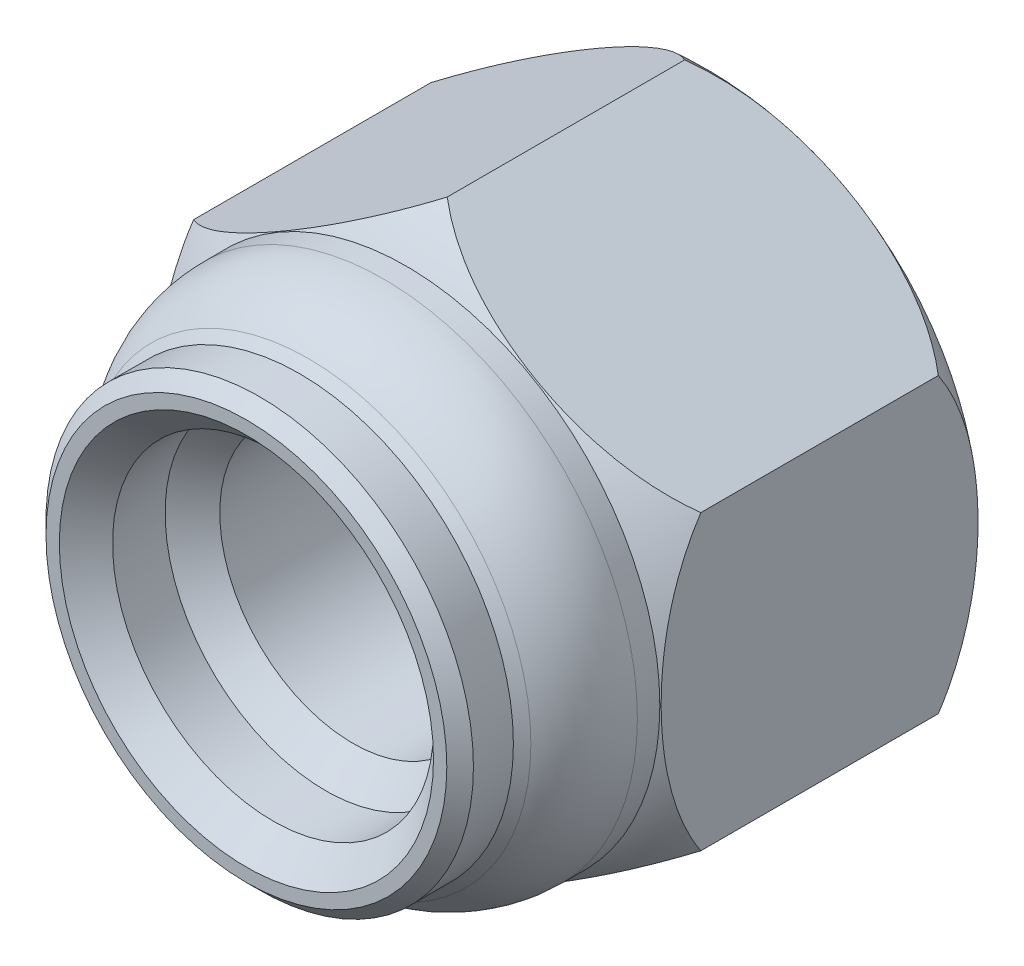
ISO-10303-21;
HEADER;
FILE_DESCRIPTION(('STEP AP214'),'2;1');
FILE_NAME('part.step','',(''),(''),'','','');
FILE_SCHEMA(('AUTOMOTIVE_DESIGN { 1 0 10303 214 1 1 1 1 }'));
ENDSEC;
DATA;
#1=APPLICATION_CONTEXT('core data for automotive mechanical design processes');
#2=APPLICATION_PROTOCOL_DEFINITION('international standard','automotive_design',2000,#1);
#3=PRODUCT_CONTEXT('',#1,'mechanical');
#4=PRODUCT('Part','Part','',(#3));
#5=PRODUCT_RELATED_PRODUCT_CATEGORY('part','',(#4));
#6=PRODUCT_DEFINITION_FORMATION('','',#4);
#7=PRODUCT_DEFINITION_CONTEXT('part definition',#1,'design');
#8=PRODUCT_DEFINITION('design','',#6,#7);
#9=PRODUCT_DEFINITION_SHAPE('','',#8);
#10=(LENGTH_UNIT() NAMED_UNIT(*) SI_UNIT(.MILLI.,.METRE.));
#11=(NAMED_UNIT(*) PLANE_ANGLE_UNIT() SI_UNIT($,.RADIAN.));
#12=(NAMED_UNIT(*) SI_UNIT($,.STERADIAN.) SOLID_ANGLE_UNIT());
#13=UNCERTAINTY_MEASURE_WITH_UNIT(LENGTH_MEASURE(1.E-05),#10,'distance_accuracy_value','');
#14=(GEOMETRIC_REPRESENTATION_CONTEXT(3) GLOBAL_UNCERTAINTY_ASSIGNED_CONTEXT((#13)) GLOBAL_UNIT_ASSIGNED_CONTEXT((#10,
#11,#12)) REPRESENTATION_CONTEXT('',''));
#15=CARTESIAN_POINT('',(0.,0.,0.));
#16=DIRECTION('',(0.,0.,1.));
#17=DIRECTION('',(1.,0.,0.));
#18=AXIS2_PLACEMENT_3D('',#15,#16,#17);
#19=CARTESIAN_POINT('',(0.,0.,0.));
#20=DIRECTION('',(0.,0.,1.));
#21=DIRECTION('',(1.,0.,0.));
#22=AXIS2_PLACEMENT_3D('',#19,#20,#21);
#23=PLANE('',#22);
#24=CARTESIAN_POINT('',(0.,0.,0.));
#25=DIRECTION('',(0.,0.,1.));
#26=DIRECTION('',(1.,0.,0.));
#27=AXIS2_PLACEMENT_3D('',#24,#25,#26);
#28=CIRCLE('',#27,2.5);
#29=CARTESIAN_POINT('',(2.5,0.,0.));
#30=VERTEX_POINT('',#29);
#31=EDGE_CURVE('E244',#30,#30,#28,.F.);
#32=ORIENTED_EDGE('',*,*,#31,.F.);
#33=EDGE_LOOP('',(#32));
#34=FACE_BOUND('',#33,.T.);
#35=CARTESIAN_POINT('',(0.,0.,0.));
#36=DIRECTION('',(0.,0.,1.));
#37=DIRECTION('',(1.,0.,0.));
#38=AXIS2_PLACEMENT_3D('',#35,#36,#37);
#39=CIRCLE('',#38,4.7296376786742);
#40=CARTESIAN_POINT('',(4.7296376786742,0.,0.));
#41=VERTEX_POINT('',#40);
#42=EDGE_CURVE('E218',#41,#41,#39,.T.);
#43=ORIENTED_EDGE('',*,*,#42,.F.);
#44=EDGE_LOOP('',(#43));
#45=FACE_BOUND('',#44,.T.);
#46=ADVANCED_FACE('F35',(#34,#45),#23,.F.);
#47=CARTESIAN_POINT('',(0.,0.,3.04443584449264));
#48=DIRECTION('',(0.,0.,-1.));
#49=DIRECTION('',(-1.,0.,0.));
#50=AXIS2_PLACEMENT_3D('',#47,#48,#49);
#51=DEGENERATE_TOROIDAL_SURFACE('',#50,2.45556415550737,3.8,.T.);
#52=CARTESIAN_POINT('',(4.7633397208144,-2.74988452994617,0.770516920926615));
#53=CARTESIAN_POINT('',(4.67367223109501,-2.80165407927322,0.701201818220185));
#54=CARTESIAN_POINT('',(4.58098003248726,-2.85516994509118,0.637410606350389));
#55=CARTESIAN_POINT('',(4.39092951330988,-2.96489566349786,0.520459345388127));
#56=CARTESIAN_POINT('',(4.29358145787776,-3.02109958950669,0.467277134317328));
#57=CARTESIAN_POINT('',(3.99761668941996,-3.19197492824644,0.323391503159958));
#58=CARTESIAN_POINT('',(3.7936097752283,-3.30975837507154,0.24726144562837));
#59=CARTESIAN_POINT('',(3.44862156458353,-3.50893741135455,0.149244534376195));
#60=CARTESIAN_POINT('',(3.30952144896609,-3.58924690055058,0.117725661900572));
#61=CARTESIAN_POINT('',(3.0294367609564,-3.75095387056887,0.0685148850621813));
#62=CARTESIAN_POINT('',(2.88845172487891,-3.83235161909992,0.0508264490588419));
#63=CARTESIAN_POINT('',(2.60493153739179,-3.9960420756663,0.0284523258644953));
#64=CARTESIAN_POINT('',(2.4623921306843,-4.078337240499,0.0238412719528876));
#65=CARTESIAN_POINT('',(2.17747110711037,-4.24283647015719,0.0276002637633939));
#66=CARTESIAN_POINT('',(2.03508945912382,-4.32504055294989,0.0359669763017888));
#67=CARTESIAN_POINT('',(1.7747807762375,-4.47532984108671,0.0636067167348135));
#68=CARTESIAN_POINT('',(1.65669446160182,-4.54350700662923,0.0808527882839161));
#69=CARTESIAN_POINT('',(1.42195219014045,-4.67903552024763,0.125199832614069));
#70=CARTESIAN_POINT('',(1.30529636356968,-4.7463867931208,0.152301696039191));
#71=CARTESIAN_POINT('',(0.960046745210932,-4.94571675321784,0.249157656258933));
#72=CARTESIAN_POINT('',(0.734356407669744,-5.07601913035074,0.334631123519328));
#73=CARTESIAN_POINT('',(0.42798641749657,-5.25290192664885,0.489846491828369));
#74=CARTESIAN_POINT('',(0.339546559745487,-5.30396270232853,0.539657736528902));
#75=CARTESIAN_POINT('',(0.16648313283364,-5.40388091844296,0.648254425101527));
#76=CARTESIAN_POINT('',(0.0818751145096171,-5.45272938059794,0.707072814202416));
#77=CARTESIAN_POINT('',(-0.000199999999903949,-5.50011547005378,0.770516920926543));
#78=B_SPLINE_CURVE_WITH_KNOTS('',3,(#52,#53,#54,#55,#56,#57,#58,#59,#60,#61,#62,#63,#64,#65,#66,
#67,#68,#69,#70,#71,#72,#73,#74,#75,#76,#77),.UNSPECIFIED.,.F.,.F.,(4,2,2,2,2,2,2,2,2,2,2,2,4),
(0.,0.373351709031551,0.745915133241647,1.48508228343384,1.97562781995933,2.46629633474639,
2.9597595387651,3.45309602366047,3.86504532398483,4.27703186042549,5.09475504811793,
5.43525226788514,5.77702605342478),.UNSPECIFIED.);
#79=CARTESIAN_POINT('',(4.76313972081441,-2.75000000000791,0.770362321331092));
#80=VERTEX_POINT('',#79);
#81=CARTESIAN_POINT('',(0.,-5.5,0.770362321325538));
#82=VERTEX_POINT('',#81);
#83=EDGE_CURVE('E58',#80,#82,#78,.T.);
#84=ORIENTED_EDGE('',*,*,#83,.T.);
#85=CARTESIAN_POINT('',(0.000199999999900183,-5.50011547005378,0.770516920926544));
#86=CARTESIAN_POINT('',(-0.0894674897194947,-5.44834592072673,0.701201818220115));
#87=CARTESIAN_POINT('',(-0.182159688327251,-5.39483005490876,0.637410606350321));
#88=CARTESIAN_POINT('',(-0.372210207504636,-5.28510433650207,0.520459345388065));
#89=CARTESIAN_POINT('',(-0.469558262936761,-5.22890041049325,0.467277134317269));
#90=CARTESIAN_POINT('',(-0.765523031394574,-5.05802507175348,0.323391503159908));
#91=CARTESIAN_POINT('',(-0.96952994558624,-4.94024162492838,0.247261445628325));
#92=CARTESIAN_POINT('',(-1.31451815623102,-4.74106258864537,0.14924453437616));
#93=CARTESIAN_POINT('',(-1.45361827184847,-4.66075309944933,0.117725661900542));
#94=CARTESIAN_POINT('',(-1.73370295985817,-4.49904612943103,0.0685148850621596));
#95=CARTESIAN_POINT('',(-1.87468799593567,-4.41764838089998,0.0508264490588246));
#96=CARTESIAN_POINT('',(-2.15820818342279,-4.2539579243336,0.0284523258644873));
#97=CARTESIAN_POINT('',(-2.30074759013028,-4.1716627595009,0.0238412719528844));
#98=CARTESIAN_POINT('',(-2.58566861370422,-4.0071635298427,0.0276002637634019));
#99=CARTESIAN_POINT('',(-2.72805026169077,-3.92495944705,0.0359669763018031));
#100=CARTESIAN_POINT('',(-2.98835894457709,-3.77467015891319,0.0636067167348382));
#101=CARTESIAN_POINT('',(-3.10644525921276,-3.70649299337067,0.0808527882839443));
#102=CARTESIAN_POINT('',(-3.34118753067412,-3.57096447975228,0.125199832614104));
#103=CARTESIAN_POINT('',(-3.45784335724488,-3.50361320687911,0.152301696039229));
#104=CARTESIAN_POINT('',(-3.80309297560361,-3.30428324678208,0.249157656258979));
#105=CARTESIAN_POINT('',(-4.02878331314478,-3.17398086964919,0.334631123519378));
#106=CARTESIAN_POINT('',(-4.33515330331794,-2.99709807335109,0.489846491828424));
#107=CARTESIAN_POINT('',(-4.42359316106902,-2.94603729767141,0.53965773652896));
#108=CARTESIAN_POINT('',(-4.59665658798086,-2.84611908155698,0.648254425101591));
#109=CARTESIAN_POINT('',(-4.68126460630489,-2.797270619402,0.707072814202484));
#110=CARTESIAN_POINT('',(-4.7633397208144,-2.74988452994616,0.770516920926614));
#111=B_SPLINE_CURVE_WITH_KNOTS('',3,(#85,#86,#87,#88,#89,#90,#91,#92,#93,#94,#95,#96,#97,#98,
#99,#100,#101,#102,#103,#104,#105,#106,#107,#108,#109,#110),.UNSPECIFIED.,.F.,.F.,(4,2,2,2,2,2,
2,2,2,2,2,2,4),(0.,0.37335170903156,0.745915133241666,1.48508228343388,1.97562781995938,
2.46629633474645,2.95975953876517,3.45309602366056,3.86504532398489,4.27703186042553,
5.09475504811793,5.43525226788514,5.77702605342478),.UNSPECIFIED.);
#112=CARTESIAN_POINT('',(-4.76313972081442,-2.75,0.770362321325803));
#113=VERTEX_POINT('',#112);
#114=EDGE_CURVE('E85',#82,#113,#111,.T.);
#115=ORIENTED_EDGE('',*,*,#114,.T.);
#116=CARTESIAN_POINT('',(-4.76313972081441,0.,0.0253142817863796));
#117=CARTESIAN_POINT('',(-4.76313972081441,0.165074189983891,0.0253139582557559));
#118=CARTESIAN_POINT('',(-4.76313972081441,0.330150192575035,0.0318465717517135));
#119=CARTESIAN_POINT('',(-4.76313972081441,0.659284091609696,0.0582965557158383));
#120=CARTESIAN_POINT('',(-4.76313972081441,0.823341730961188,0.0782171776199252));
#121=CARTESIAN_POINT('',(-4.76313972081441,1.14847437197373,0.132242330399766));
#122=CARTESIAN_POINT('',(-4.76313972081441,1.30955869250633,0.166289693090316));
#123=CARTESIAN_POINT('',(-4.76313972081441,1.62764890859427,0.249853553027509));
#124=CARTESIAN_POINT('',(-4.76313972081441,1.78465616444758,0.299364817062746));
#125=CARTESIAN_POINT('',(-4.76313972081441,2.12420085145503,0.427359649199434));
#126=CARTESIAN_POINT('',(-4.76313972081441,2.3053177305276,0.509714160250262));
#127=CARTESIAN_POINT('',(-4.76313972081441,2.65269545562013,0.701373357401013));
#128=CARTESIAN_POINT('',(-4.76313972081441,2.81897528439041,0.810642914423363));
#129=CARTESIAN_POINT('',(-4.76313972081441,3.10467482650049,1.03719428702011));
#130=CARTESIAN_POINT('',(-4.76313972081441,3.2273313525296,1.15036987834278));
#131=CARTESIAN_POINT('',(-4.76313972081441,3.45234327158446,1.39554565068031));
#132=CARTESIAN_POINT('',(-4.76313972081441,3.55470154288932,1.52754315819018));
#133=CARTESIAN_POINT('',(-4.76313972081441,3.73466933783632,1.80889914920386));
#134=CARTESIAN_POINT('',(-4.76313972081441,3.81210214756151,1.95837177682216));
#135=CARTESIAN_POINT('',(-4.76313972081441,3.93660108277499,2.26949764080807));
#136=CARTESIAN_POINT('',(-4.76313972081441,3.98368835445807,2.43114230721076));
#137=CARTESIAN_POINT('',(-4.76313972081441,4.04069302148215,2.74004823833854));
#138=CARTESIAN_POINT('',(-4.76313972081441,4.05450363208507,2.88659934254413));
#139=CARTESIAN_POINT('',(-4.76313972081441,4.05582927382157,3.17979378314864));
#140=CARTESIAN_POINT('',(-4.76313972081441,4.0433545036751,3.32643706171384));
#141=CARTESIAN_POINT('',(-4.76313972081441,3.99412694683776,3.60759708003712));
#142=CARTESIAN_POINT('',(-4.76313972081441,3.95868206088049,3.74234641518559));
#143=CARTESIAN_POINT('',(-4.76313972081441,3.86644729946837,4.00428583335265));
#144=CARTESIAN_POINT('',(-4.76313972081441,3.80965704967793,4.13147578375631));
#145=CARTESIAN_POINT('',(-4.76313972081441,3.67468432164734,4.37998349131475));
#146=CARTESIAN_POINT('',(-4.76313972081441,3.59579308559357,4.50091429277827));
#147=CARTESIAN_POINT('',(-4.76313972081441,3.4207942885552,4.72954353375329));
#148=CARTESIAN_POINT('',(-4.76313972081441,3.32468019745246,4.83723692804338));
#149=CARTESIAN_POINT('',(-4.76313972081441,3.10655886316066,5.04988717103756));
#150=CARTESIAN_POINT('',(-4.76313972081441,2.9828422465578,5.15308450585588));
#151=CARTESIAN_POINT('',(-4.76313972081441,2.72237845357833,5.34123093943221));
#152=CARTESIAN_POINT('',(-4.76313972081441,2.58562642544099,5.42617320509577));
#153=CARTESIAN_POINT('',(-4.76313972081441,2.22266481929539,5.62153598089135));
#154=CARTESIAN_POINT('',(-4.76313972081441,1.9895512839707,5.71925237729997));
#155=CARTESIAN_POINT('',(-4.76313972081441,1.63066823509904,5.83704942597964));
#156=CARTESIAN_POINT('',(-4.76313972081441,1.50923126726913,5.87156228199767));
#157=CARTESIAN_POINT('',(-4.76313972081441,1.2641554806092,5.93162406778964));
#158=CARTESIAN_POINT('',(-4.76313972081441,1.14051720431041,5.95717517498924));
#159=CARTESIAN_POINT('',(-4.76313972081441,0.848292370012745,6.00736205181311));
#160=CARTESIAN_POINT('',(-4.76313972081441,0.67911554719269,6.02854927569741));
#161=CARTESIAN_POINT('',(-4.76313972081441,0.339532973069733,6.0566676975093));
#162=CARTESIAN_POINT('',(-4.76313972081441,0.169126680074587,6.06359217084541));
#163=CARTESIAN_POINT('',(-4.76313972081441,-0.171622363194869,6.06352239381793));
#164=CARTESIAN_POINT('',(-4.76313972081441,-0.341965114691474,6.05653304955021));
#165=CARTESIAN_POINT('',(-4.76313972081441,-0.681416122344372,6.02829113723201));
#166=CARTESIAN_POINT('',(-4.76313972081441,-0.850524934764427,6.00704545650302));
#167=CARTESIAN_POINT('',(-4.76313972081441,-1.13876088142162,5.95742819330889));
#168=CARTESIAN_POINT('',(-4.76313972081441,-1.25852546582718,5.93275951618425));
#169=CARTESIAN_POINT('',(-4.76313972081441,-1.49601002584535,5.87502860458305));
#170=CARTESIAN_POINT('',(-4.76313972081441,-1.61372961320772,5.84196479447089));
#171=CARTESIAN_POINT('',(-4.76313972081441,-1.96205981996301,5.72940090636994));
#172=CARTESIAN_POINT('',(-4.76313972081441,-2.18864232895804,5.63640036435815));
#173=CARTESIAN_POINT('',(-4.76313972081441,-2.56883488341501,5.43732330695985));
#174=CARTESIAN_POINT('',(-4.76313972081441,-2.72690028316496,5.33975294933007));
#175=CARTESIAN_POINT('',(-4.76313972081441,-3.02532939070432,5.12030706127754));
#176=CARTESIAN_POINT('',(-4.76313972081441,-3.16570831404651,4.99845265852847));
#177=CARTESIAN_POINT('',(-4.76313972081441,-3.4018827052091,4.75232991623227));
#178=CARTESIAN_POINT('',(-4.76313972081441,-3.50121781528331,4.63146712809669));
#179=CARTESIAN_POINT('',(-4.76313972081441,-3.67845400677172,4.37484348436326));
#180=CARTESIAN_POINT('',(-4.76313972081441,-3.75636233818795,4.23908768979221));
#181=CARTESIAN_POINT('',(-4.76313972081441,-3.88723111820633,3.95511424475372));
#182=CARTESIAN_POINT('',(-4.76313972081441,-3.94006321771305,3.80683696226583));
#183=CARTESIAN_POINT('',(-4.76313972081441,-4.01719080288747,3.50301443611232));
#184=CARTESIAN_POINT('',(-4.76313972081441,-4.04149657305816,3.34747183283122));
#185=CARTESIAN_POINT('',(-4.76313972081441,-4.0592926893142,3.04909401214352));
#186=CARTESIAN_POINT('',(-4.76313972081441,-4.05541959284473,2.9064106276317));
#187=CARTESIAN_POINT('',(-4.76313972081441,-4.0232188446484,2.62386705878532));
#188=CARTESIAN_POINT('',(-4.76313972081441,-3.9948970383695,2.4840062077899));
#189=CARTESIAN_POINT('',(-4.76313972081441,-3.91600079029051,2.21382507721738));
#190=CARTESIAN_POINT('',(-4.76313972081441,-3.86588589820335,2.08336939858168));
#191=CARTESIAN_POINT('',(-4.76313972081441,-3.74572465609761,1.83203199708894));
#192=CARTESIAN_POINT('',(-4.76313972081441,-3.67567509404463,1.71115182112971));
#193=CARTESIAN_POINT('',(-4.76313972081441,-3.51339699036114,1.47392132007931));
#194=CARTESIAN_POINT('',(-4.76313972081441,-3.4200445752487,1.35834301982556));
#195=CARTESIAN_POINT('',(-4.76313972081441,-3.21748462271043,1.14212516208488));
#196=CARTESIAN_POINT('',(-4.76313972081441,-3.10826998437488,1.04149233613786));
#197=CARTESIAN_POINT('',(-4.76313972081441,-2.82931083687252,0.817049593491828));
#198=CARTESIAN_POINT('',(-4.76313972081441,-2.65329166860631,0.701024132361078));
#199=CARTESIAN_POINT('',(-4.76313972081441,-2.28470445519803,0.499060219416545));
#200=CARTESIAN_POINT('',(-4.76313972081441,-2.09210330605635,0.413183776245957));
#201=CARTESIAN_POINT('',(-4.76313972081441,-1.74376303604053,0.28599693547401));
#202=CARTESIAN_POINT('',(-4.76313972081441,-1.59005213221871,0.238951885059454));
#203=CARTESIAN_POINT('',(-4.76313972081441,-1.27887911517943,0.159508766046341));
#204=CARTESIAN_POINT('',(-4.76313972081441,-1.12141608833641,0.12711430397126));
#205=CARTESIAN_POINT('',(-4.76313972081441,-0.803777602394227,0.0757017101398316));
#206=CARTESIAN_POINT('',(-4.76313972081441,-0.643594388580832,0.0567324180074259));
#207=CARTESIAN_POINT('',(-4.76313972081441,-0.322274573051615,0.0315400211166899));
#208=CARTESIAN_POINT('',(-4.76313972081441,-0.161138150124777,0.0253145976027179));
#209=CARTESIAN_POINT('',(-4.76313972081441,0.,0.0253142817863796));
#210=B_SPLINE_CURVE_WITH_KNOTS('',3,(#116,#117,#118,#119,#120,#121,#122,#123,#124,#125,#126,
#127,#128,#129,#130,#131,#132,#133,#134,#135,#136,#137,#138,#139,#140,#141,#142,#143,#144,#145,
#146,#147,#148,#149,#150,#151,#152,#153,#154,#155,#156,#157,#158,#159,#160,#161,#162,#163,#164,
#165,#166,#167,#168,#169,#170,#171,#172,#173,#174,#175,#176,#177,#178,#179,#180,#181,#182,#183,
#184,#185,#186,#187,#188,#189,#190,#191,#192,#193,#194,#195,#196,#197,#198,#199,#200,#201,#202,
#203,#204,#205,#206,#207,#208,#209),.UNSPECIFIED.,.T.,.F.,(4,2,2,2,2,2,2,2,2,2,2,2,2,2,2,2,2,2,
2,2,2,2,2,2,2,2,2,2,2,2,2,2,2,2,2,2,2,2,2,2,2,2,2,2,2,2,4),(0.,0.495091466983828,
0.990303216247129,1.48353018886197,1.97659042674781,2.57143486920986,3.16550700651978,
3.66415550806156,4.16273325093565,4.66477165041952,5.16645982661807,5.6057778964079,
6.04492554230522,6.46103645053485,6.87715465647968,7.30854810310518,7.74010546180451,
8.22161364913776,8.70330175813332,9.45703176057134,9.83554447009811,10.2139651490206,
10.7247961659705,11.2358679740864,11.746759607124,12.2574046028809,12.6239445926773,
12.9905534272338,13.7213613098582,14.2766348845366,14.8314274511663,15.2988047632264,
15.7660237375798,16.2356089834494,16.7050248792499,17.1311250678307,17.5571234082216,
17.9745440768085,18.3920320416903,18.835966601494,19.2801005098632,19.9090748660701,
20.539335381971,21.0208480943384,21.5024792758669,21.985853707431,22.4691401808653),.UNSPECIFIED.);
#211=CARTESIAN_POINT('',(-4.76313972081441,2.75000000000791,0.770362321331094));
#212=VERTEX_POINT('',#211);
#213=EDGE_CURVE('E89',#113,#212,#210,.T.);
#214=ORIENTED_EDGE('',*,*,#213,.T.);
#215=CARTESIAN_POINT('',(-4.7633397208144,2.74988452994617,0.770516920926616));
#216=CARTESIAN_POINT('',(-4.67367223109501,2.80165407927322,0.701201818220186));
#217=CARTESIAN_POINT('',(-4.58098003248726,2.85516994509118,0.63741060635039));
#218=CARTESIAN_POINT('',(-4.39092951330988,2.96489566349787,0.520459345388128));
#219=CARTESIAN_POINT('',(-4.29358145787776,3.02109958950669,0.467277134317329));
#220=CARTESIAN_POINT('',(-3.99761668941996,3.19197492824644,0.32339150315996));
#221=CARTESIAN_POINT('',(-3.7936097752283,3.30975837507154,0.247261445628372));
#222=CARTESIAN_POINT('',(-3.44862156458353,3.50893741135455,0.149244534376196));
#223=CARTESIAN_POINT('',(-3.30952144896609,3.58924690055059,0.117725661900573));
#224=CARTESIAN_POINT('',(-3.0294367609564,3.75095387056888,0.0685148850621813));
#225=CARTESIAN_POINT('',(-2.8884517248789,3.83235161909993,0.0508264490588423));
#226=CARTESIAN_POINT('',(-2.60493153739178,3.99604207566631,0.0284523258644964));
#227=CARTESIAN_POINT('',(-2.4623921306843,4.078337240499,0.0238412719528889));
#228=CARTESIAN_POINT('',(-2.17747110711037,4.24283647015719,0.0276002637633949));
#229=CARTESIAN_POINT('',(-2.03508945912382,4.32504055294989,0.0359669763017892));
#230=CARTESIAN_POINT('',(-1.7747807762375,4.47532984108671,0.0636067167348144));
#231=CARTESIAN_POINT('',(-1.65669446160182,4.54350700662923,0.0808527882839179));
#232=CARTESIAN_POINT('',(-1.42195219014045,4.67903552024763,0.125199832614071));
#233=CARTESIAN_POINT('',(-1.30529636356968,4.74638679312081,0.152301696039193));
#234=CARTESIAN_POINT('',(-0.960046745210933,4.94571675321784,0.249157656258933));
#235=CARTESIAN_POINT('',(-0.734356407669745,5.07601913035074,0.334631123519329));
#236=CARTESIAN_POINT('',(-0.427986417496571,5.25290192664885,0.489846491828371));
#237=CARTESIAN_POINT('',(-0.339546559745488,5.30396270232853,0.539657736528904));
#238=CARTESIAN_POINT('',(-0.166483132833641,5.40388091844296,0.64825442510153));
#239=CARTESIAN_POINT('',(-0.0818751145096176,5.45272938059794,0.707072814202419));
#240=CARTESIAN_POINT('',(0.000199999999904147,5.50011547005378,0.770516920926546));
#241=B_SPLINE_CURVE_WITH_KNOTS('',3,(#215,#216,#217,#218,#219,#220,#221,#222,#223,#224,#225,
#226,#227,#228,#229,#230,#231,#232,#233,#234,#235,#236,#237,#238,#239,#240),.UNSPECIFIED.,.F.,
.F.,(4,2,2,2,2,2,2,2,2,2,2,2,4),(0.,0.37335170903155,0.745915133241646,1.48508228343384,
1.97562781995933,2.46629633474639,2.9597595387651,3.45309602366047,3.86504532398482,
4.27703186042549,5.09475504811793,5.43525226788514,5.77702605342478),.UNSPECIFIED.);
#242=CARTESIAN_POINT('',(0.,5.5,0.770362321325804));
#243=VERTEX_POINT('',#242);
#244=EDGE_CURVE('E105',#212,#243,#241,.T.);
#245=ORIENTED_EDGE('',*,*,#244,.T.);
#246=CARTESIAN_POINT('',(-0.000199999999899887,5.50011547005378,0.770516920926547));
#247=CARTESIAN_POINT('',(0.0894674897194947,5.44834592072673,0.701201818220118));
#248=CARTESIAN_POINT('',(0.182159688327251,5.39483005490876,0.637410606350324));
#249=CARTESIAN_POINT('',(0.372210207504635,5.28510433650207,0.520459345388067));
#250=CARTESIAN_POINT('',(0.469558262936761,5.22890041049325,0.46727713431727));
#251=CARTESIAN_POINT('',(0.765523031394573,5.05802507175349,0.323391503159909));
#252=CARTESIAN_POINT('',(0.969529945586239,4.94024162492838,0.247261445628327));
#253=CARTESIAN_POINT('',(1.31451815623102,4.74106258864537,0.149244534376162));
#254=CARTESIAN_POINT('',(1.45361827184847,4.66075309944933,0.117725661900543));
#255=CARTESIAN_POINT('',(1.73370295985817,4.49904612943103,0.0685148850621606));
#256=CARTESIAN_POINT('',(1.87468799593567,4.41764838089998,0.0508264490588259));
#257=CARTESIAN_POINT('',(2.15820818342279,4.2539579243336,0.0284523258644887));
#258=CARTESIAN_POINT('',(2.30074759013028,4.1716627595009,0.0238412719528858));
#259=CARTESIAN_POINT('',(2.58566861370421,4.00716352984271,0.0276002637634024));
#260=CARTESIAN_POINT('',(2.72805026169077,3.92495944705,0.0359669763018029));
#261=CARTESIAN_POINT('',(2.98835894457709,3.77467015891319,0.0636067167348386));
#262=CARTESIAN_POINT('',(3.10644525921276,3.70649299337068,0.0808527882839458));
#263=CARTESIAN_POINT('',(3.34118753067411,3.57096447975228,0.125199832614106));
#264=CARTESIAN_POINT('',(3.45784335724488,3.50361320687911,0.152301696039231));
#265=CARTESIAN_POINT('',(3.8030929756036,3.30428324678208,0.249157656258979));
#266=CARTESIAN_POINT('',(4.02878331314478,3.17398086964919,0.334631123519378));
#267=CARTESIAN_POINT('',(4.33515330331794,2.99709807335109,0.489846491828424));
#268=CARTESIAN_POINT('',(4.42359316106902,2.94603729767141,0.539657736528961));
#269=CARTESIAN_POINT('',(4.59665658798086,2.84611908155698,0.648254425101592));
#270=CARTESIAN_POINT('',(4.68126460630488,2.79727061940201,0.707072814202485));
#271=CARTESIAN_POINT('',(4.7633397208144,2.74988452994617,0.770516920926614));
#272=B_SPLINE_CURVE_WITH_KNOTS('',3,(#246,#247,#248,#249,#250,#251,#252,#253,#254,#255,#256,
#257,#258,#259,#260,#261,#262,#263,#264,#265,#266,#267,#268,#269,#270,#271),.UNSPECIFIED.,.F.,
.F.,(4,2,2,2,2,2,2,2,2,2,2,2,4),(0.,0.373351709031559,0.745915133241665,1.48508228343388,
1.97562781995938,2.46629633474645,2.95975953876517,3.45309602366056,3.86504532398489,
4.27703186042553,5.09475504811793,5.43525226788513,5.77702605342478),.UNSPECIFIED.);
#273=CARTESIAN_POINT('',(4.76313972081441,2.75,0.770362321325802));
#274=VERTEX_POINT('',#273);
#275=EDGE_CURVE('E161',#243,#274,#272,.T.);
#276=ORIENTED_EDGE('',*,*,#275,.T.);
#277=CARTESIAN_POINT('',(4.76313972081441,0.,0.0253142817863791));
#278=CARTESIAN_POINT('',(4.76313972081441,-0.165074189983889,0.0253139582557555));
#279=CARTESIAN_POINT('',(4.76313972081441,-0.330150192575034,0.0318465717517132));
#280=CARTESIAN_POINT('',(4.76313972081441,-0.659284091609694,0.0582965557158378));
#281=CARTESIAN_POINT('',(4.76313972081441,-0.823341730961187,0.0782171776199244));
#282=CARTESIAN_POINT('',(4.76313972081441,-1.14847437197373,0.132242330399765));
#283=CARTESIAN_POINT('',(4.76313972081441,-1.30955869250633,0.166289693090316));
#284=CARTESIAN_POINT('',(4.76313972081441,-1.62764890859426,0.249853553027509));
#285=CARTESIAN_POINT('',(4.76313972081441,-1.78465616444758,0.299364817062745));
#286=CARTESIAN_POINT('',(4.76313972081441,-2.12420085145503,0.427359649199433));
#287=CARTESIAN_POINT('',(4.76313972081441,-2.3053177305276,0.509714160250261));
#288=CARTESIAN_POINT('',(4.76313972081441,-2.65269545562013,0.701373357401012));
#289=CARTESIAN_POINT('',(4.76313972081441,-2.81897528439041,0.810642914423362));
#290=CARTESIAN_POINT('',(4.76313972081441,-3.10467482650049,1.03719428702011));
#291=CARTESIAN_POINT('',(4.76313972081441,-3.2273313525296,1.15036987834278));
#292=CARTESIAN_POINT('',(4.76313972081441,-3.45234327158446,1.39554565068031));
#293=CARTESIAN_POINT('',(4.76313972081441,-3.55470154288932,1.52754315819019));
#294=CARTESIAN_POINT('',(4.76313972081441,-3.73466933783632,1.80889914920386));
#295=CARTESIAN_POINT('',(4.76313972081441,-3.81210214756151,1.95837177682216));
#296=CARTESIAN_POINT('',(4.76313972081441,-3.93660108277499,2.26949764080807));
#297=CARTESIAN_POINT('',(4.76313972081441,-3.98368835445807,2.43114230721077));
#298=CARTESIAN_POINT('',(4.76313972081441,-4.04069302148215,2.74004823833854));
#299=CARTESIAN_POINT('',(4.76313972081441,-4.05450363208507,2.88659934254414));
#300=CARTESIAN_POINT('',(4.76313972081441,-4.05582927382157,3.17979378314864));
#301=CARTESIAN_POINT('',(4.76313972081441,-4.04335450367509,3.32643706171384));
#302=CARTESIAN_POINT('',(4.76313972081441,-3.99412694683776,3.60759708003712));
#303=CARTESIAN_POINT('',(4.76313972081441,-3.95868206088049,3.7423464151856));
#304=CARTESIAN_POINT('',(4.76313972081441,-3.86644729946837,4.00428583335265));
#305=CARTESIAN_POINT('',(4.76313972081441,-3.80965704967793,4.13147578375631));
#306=CARTESIAN_POINT('',(4.76313972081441,-3.67468432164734,4.37998349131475));
#307=CARTESIAN_POINT('',(4.76313972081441,-3.59579308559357,4.50091429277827));
#308=CARTESIAN_POINT('',(4.76313972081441,-3.4207942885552,4.72954353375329));
#309=CARTESIAN_POINT('',(4.76313972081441,-3.32468019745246,4.83723692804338));
#310=CARTESIAN_POINT('',(4.76313972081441,-3.10655886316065,5.04988717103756));
#311=CARTESIAN_POINT('',(4.76313972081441,-2.9828422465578,5.15308450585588));
#312=CARTESIAN_POINT('',(4.76313972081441,-2.72237845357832,5.34123093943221));
#313=CARTESIAN_POINT('',(4.76313972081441,-2.58562642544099,5.42617320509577));
#314=CARTESIAN_POINT('',(4.76313972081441,-2.22266481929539,5.62153598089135));
#315=CARTESIAN_POINT('',(4.76313972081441,-1.9895512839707,5.71925237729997));
#316=CARTESIAN_POINT('',(4.76313972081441,-1.63066823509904,5.83704942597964));
#317=CARTESIAN_POINT('',(4.76313972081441,-1.50923126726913,5.87156228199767));
#318=CARTESIAN_POINT('',(4.76313972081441,-1.2641554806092,5.93162406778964));
#319=CARTESIAN_POINT('',(4.76313972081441,-1.1405172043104,5.95717517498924));
#320=CARTESIAN_POINT('',(4.76313972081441,-0.848292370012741,6.00736205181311));
#321=CARTESIAN_POINT('',(4.76313972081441,-0.679115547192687,6.02854927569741));
#322=CARTESIAN_POINT('',(4.76313972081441,-0.33953297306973,6.0566676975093));
#323=CARTESIAN_POINT('',(4.76313972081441,-0.169126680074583,6.06359217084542));
#324=CARTESIAN_POINT('',(4.76313972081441,0.171622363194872,6.06352239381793));
#325=CARTESIAN_POINT('',(4.76313972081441,0.341965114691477,6.05653304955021));
#326=CARTESIAN_POINT('',(4.76313972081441,0.681416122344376,6.02829113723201));
#327=CARTESIAN_POINT('',(4.76313972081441,0.850524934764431,6.00704545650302));
#328=CARTESIAN_POINT('',(4.76313972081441,1.13876088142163,5.95742819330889));
#329=CARTESIAN_POINT('',(4.76313972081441,1.25852546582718,5.93275951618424));
#330=CARTESIAN_POINT('',(4.76313972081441,1.49601002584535,5.87502860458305));
#331=CARTESIAN_POINT('',(4.76313972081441,1.61372961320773,5.84196479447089));
#332=CARTESIAN_POINT('',(4.76313972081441,1.96205981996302,5.72940090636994));
#333=CARTESIAN_POINT('',(4.76313972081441,2.18864232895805,5.63640036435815));
#334=CARTESIAN_POINT('',(4.76313972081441,2.56883488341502,5.43732330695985));
#335=CARTESIAN_POINT('',(4.76313972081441,2.72690028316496,5.33975294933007));
#336=CARTESIAN_POINT('',(4.76313972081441,3.02532939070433,5.12030706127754));
#337=CARTESIAN_POINT('',(4.76313972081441,3.16570831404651,4.99845265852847));
#338=CARTESIAN_POINT('',(4.76313972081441,3.4018827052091,4.75232991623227));
#339=CARTESIAN_POINT('',(4.76313972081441,3.50121781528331,4.63146712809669));
#340=CARTESIAN_POINT('',(4.76313972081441,3.67845400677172,4.37484348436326));
#341=CARTESIAN_POINT('',(4.76313972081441,3.75636233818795,4.23908768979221));
#342=CARTESIAN_POINT('',(4.76313972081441,3.88723111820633,3.95511424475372));
#343=CARTESIAN_POINT('',(4.76313972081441,3.94006321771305,3.80683696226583));
#344=CARTESIAN_POINT('',(4.76313972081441,4.01719080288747,3.50301443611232));
#345=CARTESIAN_POINT('',(4.76313972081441,4.04149657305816,3.34747183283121));
#346=CARTESIAN_POINT('',(4.76313972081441,4.0592926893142,3.04909401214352));
#347=CARTESIAN_POINT('',(4.76313972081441,4.05541959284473,2.9064106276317));
#348=CARTESIAN_POINT('',(4.76313972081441,4.0232188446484,2.62386705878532));
#349=CARTESIAN_POINT('',(4.76313972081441,3.9948970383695,2.48400620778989));
#350=CARTESIAN_POINT('',(4.76313972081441,3.91600079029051,2.21382507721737));
#351=CARTESIAN_POINT('',(4.76313972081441,3.86588589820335,2.08336939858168));
#352=CARTESIAN_POINT('',(4.76313972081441,3.74572465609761,1.83203199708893));
#353=CARTESIAN_POINT('',(4.76313972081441,3.67567509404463,1.71115182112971));
#354=CARTESIAN_POINT('',(4.76313972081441,3.51339699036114,1.4739213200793));
#355=CARTESIAN_POINT('',(4.76313972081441,3.4200445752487,1.35834301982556));
#356=CARTESIAN_POINT('',(4.76313972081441,3.21748462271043,1.14212516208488));
#357=CARTESIAN_POINT('',(4.76313972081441,3.10826998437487,1.04149233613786));
#358=CARTESIAN_POINT('',(4.76313972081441,2.82931083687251,0.817049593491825));
#359=CARTESIAN_POINT('',(4.76313972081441,2.65329166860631,0.701024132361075));
#360=CARTESIAN_POINT('',(4.76313972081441,2.28470445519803,0.499060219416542));
#361=CARTESIAN_POINT('',(4.76313972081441,2.09210330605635,0.413183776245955));
#362=CARTESIAN_POINT('',(4.76313972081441,1.74376303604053,0.285996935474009));
#363=CARTESIAN_POINT('',(4.76313972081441,1.59005213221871,0.238951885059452));
#364=CARTESIAN_POINT('',(4.76313972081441,1.27887911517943,0.15950876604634));
#365=CARTESIAN_POINT('',(4.76313972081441,1.12141608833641,0.12711430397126));
#366=CARTESIAN_POINT('',(4.76313972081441,0.80377760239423,0.0757017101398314));
#367=CARTESIAN_POINT('',(4.76313972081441,0.643594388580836,0.0567324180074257));
#368=CARTESIAN_POINT('',(4.76313972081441,0.322274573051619,0.0315400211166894));
#369=CARTESIAN_POINT('',(4.76313972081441,0.16113815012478,0.0253145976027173));
#370=CARTESIAN_POINT('',(4.76313972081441,0.,0.0253142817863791));
#371=B_SPLINE_CURVE_WITH_KNOTS('',3,(#277,#278,#279,#280,#281,#282,#283,#284,#285,#286,#287,
#288,#289,#290,#291,#292,#293,#294,#295,#296,#297,#298,#299,#300,#301,#302,#303,#304,#305,#306,
#307,#308,#309,#310,#311,#312,#313,#314,#315,#316,#317,#318,#319,#320,#321,#322,#323,#324,#325,
#326,#327,#328,#329,#330,#331,#332,#333,#334,#335,#336,#337,#338,#339,#340,#341,#342,#343,#344,
#345,#346,#347,#348,#349,#350,#351,#352,#353,#354,#355,#356,#357,#358,#359,#360,#361,#362,#363,
#364,#365,#366,#367,#368,#369,#370),.UNSPECIFIED.,.T.,.F.,(4,2,2,2,2,2,2,2,2,2,2,2,2,2,2,2,2,2,
2,2,2,2,2,2,2,2,2,2,2,2,2,2,2,2,2,2,2,2,2,2,2,2,2,2,2,2,4),(0.,0.495091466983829,
0.99030321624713,1.48353018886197,1.97659042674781,2.57143486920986,3.16550700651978,
3.66415550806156,4.16273325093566,4.66477165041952,5.16645982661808,5.60577789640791,
6.04492554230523,6.46103645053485,6.87715465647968,7.30854810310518,7.74010546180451,
8.22161364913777,8.70330175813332,9.45703176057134,9.83554447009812,10.2139651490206,
10.7247961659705,11.2358679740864,11.7467596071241,12.2574046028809,12.6239445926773,
12.9905534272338,13.7213613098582,14.2766348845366,14.8314274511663,15.2988047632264,
15.7660237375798,16.2356089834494,16.7050248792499,17.1311250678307,17.5571234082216,
17.9745440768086,18.3920320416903,18.835966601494,19.2801005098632,19.9090748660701,
20.539335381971,21.0208480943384,21.5024792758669,21.985853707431,22.4691401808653),.UNSPECIFIED.);
#372=EDGE_CURVE('E168',#274,#80,#371,.T.);
#373=ORIENTED_EDGE('',*,*,#372,.T.);
#374=EDGE_LOOP('',(#84,#115,#214,#245,#276,#373));
#375=FACE_BOUND('',#374,.T.);
#376=ORIENTED_EDGE('',*,*,#42,.T.);
#377=EDGE_LOOP('',(#376));
#378=FACE_BOUND('',#377,.T.);
#379=ADVANCED_FACE('F87',(#375,#378),#51,.T.);
#380=CARTESIAN_POINT('',(0.,0.,2.95556415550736));
#381=DIRECTION('',(0.,0.,-1.));
#382=DIRECTION('',(-1.,0.,0.));
#383=AXIS2_PLACEMENT_3D('',#380,#381,#382);
#384=DEGENERATE_TOROIDAL_SURFACE('',#383,2.45556415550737,3.8,.T.);
#385=CARTESIAN_POINT('',(0.,0.,6.));
#386=DIRECTION('',(0.,0.,1.));
#387=DIRECTION('',(1.,0.,0.));
#388=AXIS2_PLACEMENT_3D('',#385,#386,#387);
#389=CIRCLE('',#388,4.7296376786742);
#390=CARTESIAN_POINT('',(4.7296376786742,0.,6.));
#391=VERTEX_POINT('',#390);
#392=EDGE_CURVE('E106',#391,#391,#389,.T.);
#393=ORIENTED_EDGE('',*,*,#392,.F.);
#394=EDGE_LOOP('',(#393));
#395=FACE_BOUND('',#394,.T.);
#396=CARTESIAN_POINT('',(4.76313972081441,0.,5.97468571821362));
#397=CARTESIAN_POINT('',(4.76313972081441,-0.165074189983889,5.97468604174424));
#398=CARTESIAN_POINT('',(4.76313972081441,-0.330150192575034,5.96815342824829));
#399=CARTESIAN_POINT('',(4.76313972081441,-0.659284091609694,5.94170344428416));
#400=CARTESIAN_POINT('',(4.76313972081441,-0.823341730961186,5.92178282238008));
#401=CARTESIAN_POINT('',(4.76313972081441,-1.14847437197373,5.86775766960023));
#402=CARTESIAN_POINT('',(4.76313972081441,-1.30955869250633,5.83371030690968));
#403=CARTESIAN_POINT('',(4.76313972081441,-1.62764890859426,5.75014644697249));
#404=CARTESIAN_POINT('',(4.76313972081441,-1.78465616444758,5.70063518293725));
#405=CARTESIAN_POINT('',(4.76313972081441,-2.12420085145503,5.57264035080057));
#406=CARTESIAN_POINT('',(4.76313972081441,-2.3053177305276,5.49028583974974));
#407=CARTESIAN_POINT('',(4.76313972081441,-2.65269545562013,5.29862664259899));
#408=CARTESIAN_POINT('',(4.76313972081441,-2.81897528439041,5.18935708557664));
#409=CARTESIAN_POINT('',(4.76313972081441,-3.10467482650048,4.96280571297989));
#410=CARTESIAN_POINT('',(4.76313972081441,-3.2273313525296,4.84963012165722));
#411=CARTESIAN_POINT('',(4.76313972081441,-3.45234327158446,4.60445434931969));
#412=CARTESIAN_POINT('',(4.76313972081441,-3.55470154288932,4.47245684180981));
#413=CARTESIAN_POINT('',(4.76313972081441,-3.73466933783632,4.19110085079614));
#414=CARTESIAN_POINT('',(4.76313972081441,-3.81210214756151,4.04162822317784));
#415=CARTESIAN_POINT('',(4.76313972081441,-3.93660108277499,3.73050235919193));
#416=CARTESIAN_POINT('',(4.76313972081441,-3.98368835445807,3.56885769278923));
#417=CARTESIAN_POINT('',(4.76313972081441,-4.04069302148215,3.25995176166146));
#418=CARTESIAN_POINT('',(4.76313972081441,-4.05450363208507,3.11340065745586));
#419=CARTESIAN_POINT('',(4.76313972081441,-4.05582927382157,2.82020621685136));
#420=CARTESIAN_POINT('',(4.76313972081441,-4.04335450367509,2.67356293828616));
#421=CARTESIAN_POINT('',(4.76313972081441,-3.99412694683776,2.39240291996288));
#422=CARTESIAN_POINT('',(4.76313972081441,-3.95868206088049,2.2576535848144));
#423=CARTESIAN_POINT('',(4.76313972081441,-3.86644729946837,1.99571416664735));
#424=CARTESIAN_POINT('',(4.76313972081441,-3.80965704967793,1.86852421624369));
#425=CARTESIAN_POINT('',(4.76313972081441,-3.67468432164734,1.62001650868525));
#426=CARTESIAN_POINT('',(4.76313972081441,-3.59579308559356,1.49908570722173));
#427=CARTESIAN_POINT('',(4.76313972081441,-3.4207942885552,1.27045646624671));
#428=CARTESIAN_POINT('',(4.76313972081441,-3.32468019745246,1.16276307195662));
#429=CARTESIAN_POINT('',(4.76313972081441,-3.10655886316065,0.950112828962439));
#430=CARTESIAN_POINT('',(4.76313972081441,-2.9828422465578,0.846915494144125));
#431=CARTESIAN_POINT('',(4.76313972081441,-2.72237845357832,0.658769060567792));
#432=CARTESIAN_POINT('',(4.76313972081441,-2.58562642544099,0.573826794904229));
#433=CARTESIAN_POINT('',(4.76313972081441,-2.22266481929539,0.37846401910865));
#434=CARTESIAN_POINT('',(4.76313972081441,-1.9895512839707,0.280747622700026));
#435=CARTESIAN_POINT('',(4.76313972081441,-1.63066823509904,0.162950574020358));
#436=CARTESIAN_POINT('',(4.76313972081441,-1.50923126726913,0.128437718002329));
#437=CARTESIAN_POINT('',(4.76313972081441,-1.2641554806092,0.0683759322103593));
#438=CARTESIAN_POINT('',(4.76313972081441,-1.1405172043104,0.0428248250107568));
#439=CARTESIAN_POINT('',(4.76313972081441,-0.848292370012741,-0.00736205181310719));
#440=CARTESIAN_POINT('',(4.76313972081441,-0.679115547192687,-0.0285492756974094));
#441=CARTESIAN_POINT('',(4.76313972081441,-0.33953297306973,-0.0566676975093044));
#442=CARTESIAN_POINT('',(4.76313972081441,-0.169126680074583,-0.0635921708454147));
#443=CARTESIAN_POINT('',(4.76313972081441,0.171622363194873,-0.0635223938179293));
#444=CARTESIAN_POINT('',(4.76313972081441,0.341965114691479,-0.0565330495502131));
#445=CARTESIAN_POINT('',(4.76313972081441,0.681416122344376,-0.0282911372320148));
#446=CARTESIAN_POINT('',(4.76313972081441,0.850524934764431,-0.00704545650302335));
#447=CARTESIAN_POINT('',(4.76313972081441,1.13876088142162,0.0425718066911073));
#448=CARTESIAN_POINT('',(4.76313972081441,1.25852546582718,0.0672404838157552));
#449=CARTESIAN_POINT('',(4.76313972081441,1.49601002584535,0.124971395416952));
#450=CARTESIAN_POINT('',(4.76313972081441,1.61372961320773,0.158035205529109));
#451=CARTESIAN_POINT('',(4.76313972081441,1.96205981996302,0.27059909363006));
#452=CARTESIAN_POINT('',(4.76313972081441,2.18864232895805,0.363599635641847));
#453=CARTESIAN_POINT('',(4.76313972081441,2.56883488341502,0.562676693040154));
#454=CARTESIAN_POINT('',(4.76313972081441,2.72690028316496,0.660247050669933));
#455=CARTESIAN_POINT('',(4.76313972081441,3.02532939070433,0.879692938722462));
#456=CARTESIAN_POINT('',(4.76313972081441,3.16570831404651,1.00154734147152));
#457=CARTESIAN_POINT('',(4.76313972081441,3.4018827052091,1.24767008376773));
#458=CARTESIAN_POINT('',(4.76313972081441,3.50121781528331,1.36853287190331));
#459=CARTESIAN_POINT('',(4.76313972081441,3.67845400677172,1.62515651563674));
#460=CARTESIAN_POINT('',(4.76313972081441,3.75636233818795,1.76091231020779));
#461=CARTESIAN_POINT('',(4.76313972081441,3.88723111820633,2.04488575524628));
#462=CARTESIAN_POINT('',(4.76313972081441,3.94006321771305,2.19316303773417));
#463=CARTESIAN_POINT('',(4.76313972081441,4.01719080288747,2.49698556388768));
#464=CARTESIAN_POINT('',(4.76313972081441,4.04149657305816,2.65252816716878));
#465=CARTESIAN_POINT('',(4.76313972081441,4.0592926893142,2.95090598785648));
#466=CARTESIAN_POINT('',(4.76313972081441,4.05541959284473,3.0935893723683));
#467=CARTESIAN_POINT('',(4.76313972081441,4.0232188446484,3.37613294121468));
#468=CARTESIAN_POINT('',(4.76313972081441,3.9948970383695,3.5159937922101));
#469=CARTESIAN_POINT('',(4.76313972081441,3.91600079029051,3.78617492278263));
#470=CARTESIAN_POINT('',(4.76313972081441,3.86588589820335,3.91663060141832));
#471=CARTESIAN_POINT('',(4.76313972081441,3.74572465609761,4.16796800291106));
#472=CARTESIAN_POINT('',(4.76313972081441,3.67567509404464,4.28884817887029));
#473=CARTESIAN_POINT('',(4.76313972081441,3.51339699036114,4.52607867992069));
#474=CARTESIAN_POINT('',(4.76313972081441,3.42004457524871,4.64165698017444));
#475=CARTESIAN_POINT('',(4.76313972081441,3.21748462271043,4.85787483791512));
#476=CARTESIAN_POINT('',(4.76313972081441,3.10826998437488,4.95850766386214));
#477=CARTESIAN_POINT('',(4.76313972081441,2.82931083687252,5.18295040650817));
#478=CARTESIAN_POINT('',(4.76313972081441,2.65329166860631,5.29897586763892));
#479=CARTESIAN_POINT('',(4.76313972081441,2.28470445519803,5.50093978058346));
#480=CARTESIAN_POINT('',(4.76313972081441,2.09210330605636,5.58681622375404));
#481=CARTESIAN_POINT('',(4.76313972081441,1.74376303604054,5.71400306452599));
#482=CARTESIAN_POINT('',(4.76313972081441,1.59005213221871,5.76104811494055));
#483=CARTESIAN_POINT('',(4.76313972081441,1.27887911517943,5.84049123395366));
#484=CARTESIAN_POINT('',(4.76313972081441,1.12141608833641,5.87288569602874));
#485=CARTESIAN_POINT('',(4.76313972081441,0.80377760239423,5.92429828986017));
#486=CARTESIAN_POINT('',(4.76313972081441,0.643594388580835,5.94326758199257));
#487=CARTESIAN_POINT('',(4.76313972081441,0.322274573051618,5.96845997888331));
#488=CARTESIAN_POINT('',(4.76313972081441,0.16113815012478,5.97468540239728));
#489=CARTESIAN_POINT('',(4.76313972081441,0.,5.97468571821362));
#490=B_SPLINE_CURVE_WITH_KNOTS('',3,(#396,#397,#398,#399,#400,#401,#402,#403,#404,#405,#406,
#407,#408,#409,#410,#411,#412,#413,#414,#415,#416,#417,#418,#419,#420,#421,#422,#423,#424,#425,
#426,#427,#428,#429,#430,#431,#432,#433,#434,#435,#436,#437,#438,#439,#440,#441,#442,#443,#444,
#445,#446,#447,#448,#449,#450,#451,#452,#453,#454,#455,#456,#457,#458,#459,#460,#461,#462,#463,
#464,#465,#466,#467,#468,#469,#470,#471,#472,#473,#474,#475,#476,#477,#478,#479,#480,#481,#482,
#483,#484,#485,#486,#487,#488,#489),.UNSPECIFIED.,.T.,.F.,(4,2,2,2,2,2,2,2,2,2,2,2,2,2,2,2,2,2,
2,2,2,2,2,2,2,2,2,2,2,2,2,2,2,2,2,2,2,2,2,2,2,2,2,2,2,2,4),(0.,0.495091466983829,
0.99030321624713,1.48353018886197,1.97659042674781,2.57143486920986,3.16550700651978,
3.66415550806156,4.16273325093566,4.66477165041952,5.16645982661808,5.60577789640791,
6.04492554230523,6.46103645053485,6.87715465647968,7.30854810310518,7.74010546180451,
8.22161364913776,8.70330175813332,9.45703176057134,9.83554447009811,10.2139651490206,
10.7247961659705,11.2358679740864,11.7467596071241,12.2574046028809,12.6239445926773,
12.9905534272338,13.7213613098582,14.2766348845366,14.8314274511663,15.2988047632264,
15.7660237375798,16.2356089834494,16.7050248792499,17.1311250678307,17.5571234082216,
17.9745440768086,18.3920320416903,18.835966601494,19.2801005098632,19.9090748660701,
20.539335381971,21.0208480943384,21.5024792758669,21.985853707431,22.4691401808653),.UNSPECIFIED.);
#491=CARTESIAN_POINT('',(4.76313972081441,2.75,5.2296376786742));
#492=VERTEX_POINT('',#491);
#493=CARTESIAN_POINT('',(4.76313972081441,-2.75000000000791,5.22963767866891));
#494=VERTEX_POINT('',#493);
#495=EDGE_CURVE('E190',#492,#494,#490,.T.);
#496=ORIENTED_EDGE('',*,*,#495,.F.);
#497=CARTESIAN_POINT('',(-0.000199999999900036,5.50011547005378,5.22948307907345));
#498=CARTESIAN_POINT('',(0.0894674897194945,5.44834592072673,5.29879818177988));
#499=CARTESIAN_POINT('',(0.182159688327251,5.39483005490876,5.36258939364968));
#500=CARTESIAN_POINT('',(0.372210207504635,5.28510433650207,5.47954065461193));
#501=CARTESIAN_POINT('',(0.46955826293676,5.22890041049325,5.53272286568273));
#502=CARTESIAN_POINT('',(0.765523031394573,5.05802507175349,5.67660849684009));
#503=CARTESIAN_POINT('',(0.969529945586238,4.94024162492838,5.75273855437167));
#504=CARTESIAN_POINT('',(1.31451815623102,4.74106258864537,5.85075546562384));
#505=CARTESIAN_POINT('',(1.45361827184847,4.66075309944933,5.88227433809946));
#506=CARTESIAN_POINT('',(1.73370295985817,4.49904612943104,5.93148511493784));
#507=CARTESIAN_POINT('',(1.87468799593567,4.41764838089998,5.94917355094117));
#508=CARTESIAN_POINT('',(2.15820818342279,4.2539579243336,5.97154767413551));
#509=CARTESIAN_POINT('',(2.30074759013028,4.1716627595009,5.97615872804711));
#510=CARTESIAN_POINT('',(2.58566861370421,4.00716352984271,5.9723997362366));
#511=CARTESIAN_POINT('',(2.72805026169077,3.92495944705,5.9640330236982));
#512=CARTESIAN_POINT('',(2.98835894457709,3.77467015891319,5.93639328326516));
#513=CARTESIAN_POINT('',(3.10644525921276,3.70649299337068,5.91914721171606));
#514=CARTESIAN_POINT('',(3.34118753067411,3.57096447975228,5.87480016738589));
#515=CARTESIAN_POINT('',(3.45784335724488,3.50361320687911,5.84769830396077));
#516=CARTESIAN_POINT('',(3.8030929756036,3.30428324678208,5.75084234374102));
#517=CARTESIAN_POINT('',(4.02878331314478,3.17398086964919,5.66536887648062));
#518=CARTESIAN_POINT('',(4.33515330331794,2.99709807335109,5.51015350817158));
#519=CARTESIAN_POINT('',(4.42359316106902,2.94603729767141,5.46034226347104));
#520=CARTESIAN_POINT('',(4.59665658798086,2.84611908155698,5.35174557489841));
#521=CARTESIAN_POINT('',(4.68126460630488,2.79727061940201,5.29292718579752));
#522=CARTESIAN_POINT('',(4.7633397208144,2.74988452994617,5.22948307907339));
#523=B_SPLINE_CURVE_WITH_KNOTS('',3,(#497,#498,#499,#500,#501,#502,#503,#504,#505,#506,#507,
#508,#509,#510,#511,#512,#513,#514,#515,#516,#517,#518,#519,#520,#521,#522),.UNSPECIFIED.,.F.,
.F.,(4,2,2,2,2,2,2,2,2,2,2,2,4),(0.,0.37335170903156,0.745915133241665,1.48508228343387,
1.97562781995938,2.46629633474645,2.95975953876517,3.45309602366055,3.86504532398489,
4.27703186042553,5.09475504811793,5.43525226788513,5.77702605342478),.UNSPECIFIED.);
#524=CARTESIAN_POINT('',(0.,5.5,5.2296376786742));
#525=VERTEX_POINT('',#524);
#526=EDGE_CURVE('E196',#525,#492,#523,.T.);
#527=ORIENTED_EDGE('',*,*,#526,.F.);
#528=CARTESIAN_POINT('',(-4.7633397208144,2.74988452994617,5.22948307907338));
#529=CARTESIAN_POINT('',(-4.67367223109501,2.80165407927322,5.29879818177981));
#530=CARTESIAN_POINT('',(-4.58098003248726,2.85516994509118,5.36258939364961));
#531=CARTESIAN_POINT('',(-4.39092951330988,2.96489566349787,5.47954065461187));
#532=CARTESIAN_POINT('',(-4.29358145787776,3.02109958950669,5.53272286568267));
#533=CARTESIAN_POINT('',(-3.99761668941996,3.19197492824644,5.67660849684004));
#534=CARTESIAN_POINT('',(-3.7936097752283,3.30975837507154,5.75273855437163));
#535=CARTESIAN_POINT('',(-3.44862156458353,3.50893741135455,5.8507554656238));
#536=CARTESIAN_POINT('',(-3.30952144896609,3.58924690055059,5.88227433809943));
#537=CARTESIAN_POINT('',(-3.0294367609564,3.75095387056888,5.93148511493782));
#538=CARTESIAN_POINT('',(-2.8884517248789,3.83235161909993,5.94917355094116));
#539=CARTESIAN_POINT('',(-2.60493153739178,3.99604207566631,5.9715476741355));
#540=CARTESIAN_POINT('',(-2.4623921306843,4.078337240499,5.97615872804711));
#541=CARTESIAN_POINT('',(-2.17747110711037,4.24283647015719,5.9723997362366));
#542=CARTESIAN_POINT('',(-2.03508945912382,4.32504055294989,5.96403302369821));
#543=CARTESIAN_POINT('',(-1.7747807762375,4.47532984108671,5.93639328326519));
#544=CARTESIAN_POINT('',(-1.65669446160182,4.54350700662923,5.91914721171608));
#545=CARTESIAN_POINT('',(-1.42195219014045,4.67903552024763,5.87480016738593));
#546=CARTESIAN_POINT('',(-1.30529636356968,4.74638679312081,5.84769830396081));
#547=CARTESIAN_POINT('',(-0.960046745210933,4.94571675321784,5.75084234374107));
#548=CARTESIAN_POINT('',(-0.734356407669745,5.07601913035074,5.66536887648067));
#549=CARTESIAN_POINT('',(-0.427986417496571,5.25290192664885,5.51015350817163));
#550=CARTESIAN_POINT('',(-0.339546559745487,5.30396270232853,5.4603422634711));
#551=CARTESIAN_POINT('',(-0.16648313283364,5.40388091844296,5.35174557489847));
#552=CARTESIAN_POINT('',(-0.0818751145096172,5.45272938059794,5.29292718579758));
#553=CARTESIAN_POINT('',(0.000199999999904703,5.50011547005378,5.22948307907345));
#554=B_SPLINE_CURVE_WITH_KNOTS('',3,(#528,#529,#530,#531,#532,#533,#534,#535,#536,#537,#538,
#539,#540,#541,#542,#543,#544,#545,#546,#547,#548,#549,#550,#551,#552,#553),.UNSPECIFIED.,.F.,
.F.,(4,2,2,2,2,2,2,2,2,2,2,2,4),(0.,0.373351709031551,0.745915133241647,1.48508228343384,
1.97562781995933,2.46629633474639,2.9597595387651,3.45309602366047,3.86504532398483,
4.27703186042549,5.09475504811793,5.43525226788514,5.77702605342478),.UNSPECIFIED.);
#555=CARTESIAN_POINT('',(-4.76313972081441,2.75000000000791,5.22963767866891));
#556=VERTEX_POINT('',#555);
#557=EDGE_CURVE('E216',#556,#525,#554,.T.);
#558=ORIENTED_EDGE('',*,*,#557,.F.);
#559=CARTESIAN_POINT('',(-4.76313972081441,0.,5.97468571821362));
#560=CARTESIAN_POINT('',(-4.76313972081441,0.16507418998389,5.97468604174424));
#561=CARTESIAN_POINT('',(-4.76313972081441,0.330150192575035,5.96815342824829));
#562=CARTESIAN_POINT('',(-4.76313972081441,0.659284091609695,5.94170344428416));
#563=CARTESIAN_POINT('',(-4.76313972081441,0.823341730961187,5.92178282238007));
#564=CARTESIAN_POINT('',(-4.76313972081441,1.14847437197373,5.86775766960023));
#565=CARTESIAN_POINT('',(-4.76313972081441,1.30955869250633,5.83371030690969));
#566=CARTESIAN_POINT('',(-4.76313972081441,1.62764890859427,5.75014644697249));
#567=CARTESIAN_POINT('',(-4.76313972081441,1.78465616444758,5.70063518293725));
#568=CARTESIAN_POINT('',(-4.76313972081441,2.12420085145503,5.57264035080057));
#569=CARTESIAN_POINT('',(-4.76313972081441,2.3053177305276,5.49028583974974));
#570=CARTESIAN_POINT('',(-4.76313972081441,2.65269545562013,5.29862664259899));
#571=CARTESIAN_POINT('',(-4.76313972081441,2.81897528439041,5.18935708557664));
#572=CARTESIAN_POINT('',(-4.76313972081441,3.10467482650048,4.96280571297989));
#573=CARTESIAN_POINT('',(-4.76313972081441,3.2273313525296,4.84963012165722));
#574=CARTESIAN_POINT('',(-4.76313972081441,3.45234327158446,4.60445434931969));
#575=CARTESIAN_POINT('',(-4.76313972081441,3.55470154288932,4.47245684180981));
#576=CARTESIAN_POINT('',(-4.76313972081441,3.73466933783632,4.19110085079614));
#577=CARTESIAN_POINT('',(-4.76313972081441,3.81210214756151,4.04162822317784));
#578=CARTESIAN_POINT('',(-4.76313972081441,3.93660108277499,3.73050235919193));
#579=CARTESIAN_POINT('',(-4.76313972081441,3.98368835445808,3.56885769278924));
#580=CARTESIAN_POINT('',(-4.76313972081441,4.04069302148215,3.25995176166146));
#581=CARTESIAN_POINT('',(-4.76313972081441,4.05450363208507,3.11340065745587));
#582=CARTESIAN_POINT('',(-4.76313972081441,4.05582927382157,2.82020621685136));
#583=CARTESIAN_POINT('',(-4.76313972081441,4.0433545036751,2.67356293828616));
#584=CARTESIAN_POINT('',(-4.76313972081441,3.99412694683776,2.39240291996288));
#585=CARTESIAN_POINT('',(-4.76313972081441,3.95868206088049,2.2576535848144));
#586=CARTESIAN_POINT('',(-4.76313972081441,3.86644729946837,1.99571416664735));
#587=CARTESIAN_POINT('',(-4.76313972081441,3.80965704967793,1.86852421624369));
#588=CARTESIAN_POINT('',(-4.76313972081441,3.67468432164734,1.62001650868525));
#589=CARTESIAN_POINT('',(-4.76313972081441,3.59579308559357,1.49908570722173));
#590=CARTESIAN_POINT('',(-4.76313972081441,3.4207942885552,1.27045646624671));
#591=CARTESIAN_POINT('',(-4.76313972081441,3.32468019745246,1.16276307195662));
#592=CARTESIAN_POINT('',(-4.76313972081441,3.10655886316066,0.95011282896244));
#593=CARTESIAN_POINT('',(-4.76313972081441,2.9828422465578,0.846915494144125));
#594=CARTESIAN_POINT('',(-4.76313972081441,2.72237845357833,0.658769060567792));
#595=CARTESIAN_POINT('',(-4.76313972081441,2.58562642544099,0.573826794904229));
#596=CARTESIAN_POINT('',(-4.76313972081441,2.22266481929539,0.378464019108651));
#597=CARTESIAN_POINT('',(-4.76313972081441,1.9895512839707,0.280747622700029));
#598=CARTESIAN_POINT('',(-4.76313972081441,1.63066823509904,0.162950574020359));
#599=CARTESIAN_POINT('',(-4.76313972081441,1.50923126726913,0.12843771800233));
#600=CARTESIAN_POINT('',(-4.76313972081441,1.2641554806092,0.0683759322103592));
#601=CARTESIAN_POINT('',(-4.76313972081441,1.14051720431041,0.0428248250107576));
#602=CARTESIAN_POINT('',(-4.76313972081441,0.848292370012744,-0.00736205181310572));
#603=CARTESIAN_POINT('',(-4.76313972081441,0.67911554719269,-0.0285492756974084));
#604=CARTESIAN_POINT('',(-4.76313972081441,0.339532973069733,-0.0566676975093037));
#605=CARTESIAN_POINT('',(-4.76313972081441,0.169126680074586,-0.063592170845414));
#606=CARTESIAN_POINT('',(-4.76313972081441,-0.171622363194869,-0.0635223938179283));
#607=CARTESIAN_POINT('',(-4.76313972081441,-0.341965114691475,-0.0565330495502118));
#608=CARTESIAN_POINT('',(-4.76313972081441,-0.681416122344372,-0.0282911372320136));
#609=CARTESIAN_POINT('',(-4.76313972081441,-0.850524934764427,-0.0070454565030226));
#610=CARTESIAN_POINT('',(-4.76313972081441,-1.13876088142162,0.042571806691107));
#611=CARTESIAN_POINT('',(-4.76313972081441,-1.25852546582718,0.0672404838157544));
#612=CARTESIAN_POINT('',(-4.76313972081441,-1.49601002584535,0.124971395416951));
#613=CARTESIAN_POINT('',(-4.76313972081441,-1.61372961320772,0.158035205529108));
#614=CARTESIAN_POINT('',(-4.76313972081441,-1.96205981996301,0.27059909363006));
#615=CARTESIAN_POINT('',(-4.76313972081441,-2.18864232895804,0.363599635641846));
#616=CARTESIAN_POINT('',(-4.76313972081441,-2.56883488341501,0.562676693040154));
#617=CARTESIAN_POINT('',(-4.76313972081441,-2.72690028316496,0.660247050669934));
#618=CARTESIAN_POINT('',(-4.76313972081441,-3.02532939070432,0.879692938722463));
#619=CARTESIAN_POINT('',(-4.76313972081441,-3.16570831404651,1.00154734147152));
#620=CARTESIAN_POINT('',(-4.76313972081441,-3.4018827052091,1.24767008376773));
#621=CARTESIAN_POINT('',(-4.76313972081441,-3.50121781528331,1.36853287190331));
#622=CARTESIAN_POINT('',(-4.76313972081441,-3.67845400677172,1.62515651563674));
#623=CARTESIAN_POINT('',(-4.76313972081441,-3.75636233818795,1.76091231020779));
#624=CARTESIAN_POINT('',(-4.76313972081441,-3.88723111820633,2.04488575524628));
#625=CARTESIAN_POINT('',(-4.76313972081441,-3.94006321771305,2.19316303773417));
#626=CARTESIAN_POINT('',(-4.76313972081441,-4.01719080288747,2.49698556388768));
#627=CARTESIAN_POINT('',(-4.76313972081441,-4.04149657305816,2.65252816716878));
#628=CARTESIAN_POINT('',(-4.76313972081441,-4.0592926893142,2.95090598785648));
#629=CARTESIAN_POINT('',(-4.76313972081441,-4.05541959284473,3.0935893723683));
#630=CARTESIAN_POINT('',(-4.76313972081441,-4.0232188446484,3.37613294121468));
#631=CARTESIAN_POINT('',(-4.76313972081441,-3.9948970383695,3.51599379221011));
#632=CARTESIAN_POINT('',(-4.76313972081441,-3.9160007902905,3.78617492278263));
#633=CARTESIAN_POINT('',(-4.76313972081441,-3.86588589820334,3.91663060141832));
#634=CARTESIAN_POINT('',(-4.76313972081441,-3.74572465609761,4.16796800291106));
#635=CARTESIAN_POINT('',(-4.76313972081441,-3.67567509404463,4.28884817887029));
#636=CARTESIAN_POINT('',(-4.76313972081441,-3.51339699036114,4.52607867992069));
#637=CARTESIAN_POINT('',(-4.76313972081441,-3.4200445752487,4.64165698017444));
#638=CARTESIAN_POINT('',(-4.76313972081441,-3.21748462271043,4.85787483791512));
#639=CARTESIAN_POINT('',(-4.76313972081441,-3.10826998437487,4.95850766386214));
#640=CARTESIAN_POINT('',(-4.76313972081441,-2.82931083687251,5.18295040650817));
#641=CARTESIAN_POINT('',(-4.76313972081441,-2.65329166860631,5.29897586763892));
#642=CARTESIAN_POINT('',(-4.76313972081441,-2.28470445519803,5.50093978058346));
#643=CARTESIAN_POINT('',(-4.76313972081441,-2.09210330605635,5.58681622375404));
#644=CARTESIAN_POINT('',(-4.76313972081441,-1.74376303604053,5.71400306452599));
#645=CARTESIAN_POINT('',(-4.76313972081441,-1.59005213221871,5.76104811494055));
#646=CARTESIAN_POINT('',(-4.76313972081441,-1.27887911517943,5.84049123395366));
#647=CARTESIAN_POINT('',(-4.76313972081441,-1.12141608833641,5.87288569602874));
#648=CARTESIAN_POINT('',(-4.76313972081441,-0.803777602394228,5.92429828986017));
#649=CARTESIAN_POINT('',(-4.76313972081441,-0.643594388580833,5.94326758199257));
#650=CARTESIAN_POINT('',(-4.76313972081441,-0.322274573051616,5.96845997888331));
#651=CARTESIAN_POINT('',(-4.76313972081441,-0.161138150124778,5.97468540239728));
#652=CARTESIAN_POINT('',(-4.76313972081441,0.,5.97468571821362));
#653=B_SPLINE_CURVE_WITH_KNOTS('',3,(#559,#560,#561,#562,#563,#564,#565,#566,#567,#568,#569,
#570,#571,#572,#573,#574,#575,#576,#577,#578,#579,#580,#581,#582,#583,#584,#585,#586,#587,#588,
#589,#590,#591,#592,#593,#594,#595,#596,#597,#598,#599,#600,#601,#602,#603,#604,#605,#606,#607,
#608,#609,#610,#611,#612,#613,#614,#615,#616,#617,#618,#619,#620,#621,#622,#623,#624,#625,#626,
#627,#628,#629,#630,#631,#632,#633,#634,#635,#636,#637,#638,#639,#640,#641,#642,#643,#644,#645,
#646,#647,#648,#649,#650,#651,#652),.UNSPECIFIED.,.T.,.F.,(4,2,2,2,2,2,2,2,2,2,2,2,2,2,2,2,2,2,
2,2,2,2,2,2,2,2,2,2,2,2,2,2,2,2,2,2,2,2,2,2,2,2,2,2,2,2,4),(0.,0.495091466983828,
0.990303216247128,1.48353018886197,1.97659042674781,2.57143486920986,3.16550700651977,
3.66415550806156,4.16273325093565,4.66477165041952,5.16645982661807,5.6057778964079,
6.04492554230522,6.46103645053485,6.87715465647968,7.30854810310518,7.74010546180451,
8.22161364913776,8.70330175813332,9.45703176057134,9.83554447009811,10.2139651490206,
10.7247961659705,11.2358679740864,11.746759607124,12.2574046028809,12.6239445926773,
12.9905534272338,13.7213613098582,14.2766348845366,14.8314274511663,15.2988047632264,
15.7660237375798,16.2356089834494,16.7050248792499,17.1311250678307,17.5571234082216,
17.9745440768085,18.3920320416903,18.835966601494,19.2801005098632,19.9090748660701,
20.539335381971,21.0208480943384,21.5024792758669,21.985853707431,22.4691401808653),.UNSPECIFIED.);
#654=CARTESIAN_POINT('',(-4.76313972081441,-2.75,5.2296376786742));
#655=VERTEX_POINT('',#654);
#656=EDGE_CURVE('E50',#655,#556,#653,.T.);
#657=ORIENTED_EDGE('',*,*,#656,.F.);
#658=CARTESIAN_POINT('',(0.000199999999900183,-5.50011547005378,5.22948307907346));
#659=CARTESIAN_POINT('',(-0.0894674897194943,-5.44834592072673,5.29879818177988));
#660=CARTESIAN_POINT('',(-0.182159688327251,-5.39483005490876,5.36258939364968));
#661=CARTESIAN_POINT('',(-0.372210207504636,-5.28510433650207,5.47954065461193));
#662=CARTESIAN_POINT('',(-0.469558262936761,-5.22890041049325,5.53272286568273));
#663=CARTESIAN_POINT('',(-0.765523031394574,-5.05802507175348,5.67660849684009));
#664=CARTESIAN_POINT('',(-0.969529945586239,-4.94024162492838,5.75273855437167));
#665=CARTESIAN_POINT('',(-1.31451815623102,-4.74106258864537,5.85075546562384));
#666=CARTESIAN_POINT('',(-1.45361827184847,-4.66075309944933,5.88227433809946));
#667=CARTESIAN_POINT('',(-1.73370295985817,-4.49904612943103,5.93148511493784));
#668=CARTESIAN_POINT('',(-1.87468799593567,-4.41764838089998,5.94917355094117));
#669=CARTESIAN_POINT('',(-2.15820818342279,-4.2539579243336,5.97154767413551));
#670=CARTESIAN_POINT('',(-2.30074759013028,-4.1716627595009,5.97615872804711));
#671=CARTESIAN_POINT('',(-2.58566861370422,-4.0071635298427,5.9723997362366));
#672=CARTESIAN_POINT('',(-2.72805026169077,-3.92495944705,5.9640330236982));
#673=CARTESIAN_POINT('',(-2.98835894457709,-3.77467015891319,5.93639328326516));
#674=CARTESIAN_POINT('',(-3.10644525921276,-3.70649299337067,5.91914721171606));
#675=CARTESIAN_POINT('',(-3.34118753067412,-3.57096447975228,5.8748001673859));
#676=CARTESIAN_POINT('',(-3.45784335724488,-3.50361320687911,5.84769830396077));
#677=CARTESIAN_POINT('',(-3.80309297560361,-3.30428324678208,5.75084234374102));
#678=CARTESIAN_POINT('',(-4.02878331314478,-3.17398086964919,5.66536887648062));
#679=CARTESIAN_POINT('',(-4.33515330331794,-2.99709807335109,5.51015350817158));
#680=CARTESIAN_POINT('',(-4.42359316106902,-2.94603729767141,5.46034226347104));
#681=CARTESIAN_POINT('',(-4.59665658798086,-2.84611908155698,5.35174557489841));
#682=CARTESIAN_POINT('',(-4.68126460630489,-2.797270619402,5.29292718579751));
#683=CARTESIAN_POINT('',(-4.76333972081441,-2.74988452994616,5.22948307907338));
#684=B_SPLINE_CURVE_WITH_KNOTS('',3,(#658,#659,#660,#661,#662,#663,#664,#665,#666,#667,#668,
#669,#670,#671,#672,#673,#674,#675,#676,#677,#678,#679,#680,#681,#682,#683),.UNSPECIFIED.,.F.,
.F.,(4,2,2,2,2,2,2,2,2,2,2,2,4),(0.,0.37335170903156,0.745915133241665,1.48508228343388,
1.97562781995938,2.46629633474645,2.95975953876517,3.45309602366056,3.86504532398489,
4.27703186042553,5.09475504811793,5.43525226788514,5.77702605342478),.UNSPECIFIED.);
#685=CARTESIAN_POINT('',(-3.39299727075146E-13,-5.4999999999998,5.22963767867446));
#686=VERTEX_POINT('',#685);
#687=EDGE_CURVE('E95',#686,#655,#684,.T.);
#688=ORIENTED_EDGE('',*,*,#687,.F.);
#689=CARTESIAN_POINT('',(4.7633397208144,-2.74988452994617,5.22948307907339));
#690=CARTESIAN_POINT('',(4.67367223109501,-2.80165407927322,5.29879818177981));
#691=CARTESIAN_POINT('',(4.58098003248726,-2.85516994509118,5.36258939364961));
#692=CARTESIAN_POINT('',(4.39092951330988,-2.96489566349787,5.47954065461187));
#693=CARTESIAN_POINT('',(4.29358145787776,-3.02109958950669,5.53272286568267));
#694=CARTESIAN_POINT('',(3.99761668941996,-3.19197492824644,5.67660849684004));
#695=CARTESIAN_POINT('',(3.7936097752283,-3.30975837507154,5.75273855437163));
#696=CARTESIAN_POINT('',(3.44862156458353,-3.50893741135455,5.8507554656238));
#697=CARTESIAN_POINT('',(3.30952144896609,-3.58924690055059,5.88227433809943));
#698=CARTESIAN_POINT('',(3.0294367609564,-3.75095387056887,5.93148511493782));
#699=CARTESIAN_POINT('',(2.8884517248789,-3.83235161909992,5.94917355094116));
#700=CARTESIAN_POINT('',(2.60493153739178,-3.99604207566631,5.9715476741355));
#701=CARTESIAN_POINT('',(2.4623921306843,-4.078337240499,5.97615872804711));
#702=CARTESIAN_POINT('',(2.17747110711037,-4.24283647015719,5.97239973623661));
#703=CARTESIAN_POINT('',(2.03508945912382,-4.32504055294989,5.96403302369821));
#704=CARTESIAN_POINT('',(1.7747807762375,-4.47532984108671,5.93639328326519));
#705=CARTESIAN_POINT('',(1.65669446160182,-4.54350700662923,5.91914721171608));
#706=CARTESIAN_POINT('',(1.42195219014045,-4.67903552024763,5.87480016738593));
#707=CARTESIAN_POINT('',(1.30529636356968,-4.7463867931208,5.84769830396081));
#708=CARTESIAN_POINT('',(0.960046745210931,-4.94571675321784,5.75084234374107));
#709=CARTESIAN_POINT('',(0.734356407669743,-5.07601913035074,5.66536887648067));
#710=CARTESIAN_POINT('',(0.427986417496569,-5.25290192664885,5.51015350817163));
#711=CARTESIAN_POINT('',(0.339546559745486,-5.30396270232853,5.4603422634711));
#712=CARTESIAN_POINT('',(0.166483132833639,-5.40388091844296,5.35174557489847));
#713=CARTESIAN_POINT('',(0.0818751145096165,-5.45272938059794,5.29292718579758));
#714=CARTESIAN_POINT('',(-0.000199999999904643,-5.50011547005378,5.22948307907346));
#715=B_SPLINE_CURVE_WITH_KNOTS('',3,(#689,#690,#691,#692,#693,#694,#695,#696,#697,#698,#699,
#700,#701,#702,#703,#704,#705,#706,#707,#708,#709,#710,#711,#712,#713,#714),.UNSPECIFIED.,.F.,
.F.,(4,2,2,2,2,2,2,2,2,2,2,2,4),(0.,0.37335170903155,0.745915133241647,1.48508228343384,
1.97562781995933,2.46629633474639,2.9597595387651,3.45309602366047,3.86504532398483,
4.27703186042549,5.09475504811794,5.43525226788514,5.77702605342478),.UNSPECIFIED.);
#716=EDGE_CURVE('E113',#494,#686,#715,.T.);
#717=ORIENTED_EDGE('',*,*,#716,.F.);
#718=EDGE_LOOP('',(#496,#527,#558,#657,#688,#717));
#719=FACE_BOUND('',#718,.T.);
#720=ADVANCED_FACE('F141',(#395,#719),#384,.T.);
#721=CARTESIAN_POINT('',(-4.76313972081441,-2.75,6.));
#722=DIRECTION('',(0.5,0.866025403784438,0.));
#723=DIRECTION('',(-0.866025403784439,0.5,0.));
#724=AXIS2_PLACEMENT_3D('',#721,#722,#723);
#725=PLANE('',#724);
#726=DIRECTION('',(0.,0.,-1.));
#727=VECTOR('',#726,1.);
#728=CARTESIAN_POINT('',(0.,-5.5,6.));
#729=LINE('',#728,#727);
#730=EDGE_CURVE('E109',#686,#82,#729,.T.);
#731=ORIENTED_EDGE('',*,*,#730,.F.);
#732=ORIENTED_EDGE('',*,*,#687,.T.);
#733=DIRECTION('',(0.,0.,-1.));
#734=VECTOR('',#733,1.);
#735=CARTESIAN_POINT('',(-4.76313972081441,-2.75,6.));
#736=LINE('',#735,#734);
#737=EDGE_CURVE('E102',#655,#113,#736,.T.);
#738=ORIENTED_EDGE('',*,*,#737,.T.);
#739=ORIENTED_EDGE('',*,*,#114,.F.);
#740=EDGE_LOOP('',(#731,#732,#738,#739));
#741=FACE_BOUND('',#740,.T.);
#742=ADVANCED_FACE('F108',(#741),#725,.F.);
#743=CARTESIAN_POINT('',(-4.76313972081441,2.75,6.));
#744=DIRECTION('',(1.,0.,0.));
#745=DIRECTION('',(0.,1.,0.));
#746=AXIS2_PLACEMENT_3D('',#743,#744,#745);
#747=PLANE('',#746);
#748=ORIENTED_EDGE('',*,*,#737,.F.);
#749=ORIENTED_EDGE('',*,*,#656,.T.);
#750=DIRECTION('',(0.,0.,-1.));
#751=VECTOR('',#750,1.);
#752=CARTESIAN_POINT('',(-4.76313972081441,2.75,6.));
#753=LINE('',#752,#751);
#754=EDGE_CURVE('E104',#556,#212,#753,.T.);
#755=ORIENTED_EDGE('',*,*,#754,.T.);
#756=ORIENTED_EDGE('',*,*,#213,.F.);
#757=EDGE_LOOP('',(#748,#749,#755,#756));
#758=FACE_BOUND('',#757,.T.);
#759=ADVANCED_FACE('F101',(#758),#747,.F.);
#760=CARTESIAN_POINT('',(0.,5.5,6.));
#761=DIRECTION('',(0.5,-0.866025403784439,0.));
#762=DIRECTION('',(0.866025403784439,0.5,0.));
#763=AXIS2_PLACEMENT_3D('',#760,#761,#762);
#764=PLANE('',#763);
#765=ORIENTED_EDGE('',*,*,#754,.F.);
#766=ORIENTED_EDGE('',*,*,#557,.T.);
#767=DIRECTION('',(0.,0.,-1.));
#768=VECTOR('',#767,1.);
#769=CARTESIAN_POINT('',(0.,5.5,6.));
#770=LINE('',#769,#768);
#771=EDGE_CURVE('E111',#525,#243,#770,.T.);
#772=ORIENTED_EDGE('',*,*,#771,.T.);
#773=ORIENTED_EDGE('',*,*,#244,.F.);
#774=EDGE_LOOP('',(#765,#766,#772,#773));
#775=FACE_BOUND('',#774,.T.);
#776=ADVANCED_FACE('F227',(#775),#764,.F.);
#777=CARTESIAN_POINT('',(4.76313972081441,2.75,6.));
#778=DIRECTION('',(-0.5,-0.866025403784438,0.));
#779=DIRECTION('',(0.866025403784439,-0.5,0.));
#780=AXIS2_PLACEMENT_3D('',#777,#778,#779);
#781=PLANE('',#780);
#782=ORIENTED_EDGE('',*,*,#771,.F.);
#783=ORIENTED_EDGE('',*,*,#526,.T.);
#784=DIRECTION('',(0.,0.,-1.));
#785=VECTOR('',#784,1.);
#786=CARTESIAN_POINT('',(4.76313972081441,2.75,6.));
#787=LINE('',#786,#785);
#788=EDGE_CURVE('E119',#492,#274,#787,.T.);
#789=ORIENTED_EDGE('',*,*,#788,.T.);
#790=ORIENTED_EDGE('',*,*,#275,.F.);
#791=EDGE_LOOP('',(#782,#783,#789,#790));
#792=FACE_BOUND('',#791,.T.);
#793=ADVANCED_FACE('F183',(#792),#781,.F.);
#794=CARTESIAN_POINT('',(4.76313972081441,-2.75,6.));
#795=DIRECTION('',(-1.,0.,0.));
#796=DIRECTION('',(0.,0.,1.));
#797=AXIS2_PLACEMENT_3D('',#794,#795,#796);
#798=PLANE('',#797);
#799=ORIENTED_EDGE('',*,*,#788,.F.);
#800=ORIENTED_EDGE('',*,*,#495,.T.);
#801=DIRECTION('',(0.,0.,-1.));
#802=VECTOR('',#801,1.);
#803=CARTESIAN_POINT('',(4.76313972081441,-2.75,6.));
#804=LINE('',#803,#802);
#805=EDGE_CURVE('E96',#494,#80,#804,.T.);
#806=ORIENTED_EDGE('',*,*,#805,.T.);
#807=ORIENTED_EDGE('',*,*,#372,.F.);
#808=EDGE_LOOP('',(#799,#800,#806,#807));
#809=FACE_BOUND('',#808,.T.);
#810=ADVANCED_FACE('F179',(#809),#798,.F.);
#811=CARTESIAN_POINT('',(0.,-5.5,6.));
#812=DIRECTION('',(-0.5,0.866025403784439,0.));
#813=DIRECTION('',(-0.866025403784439,-0.5,0.));
#814=AXIS2_PLACEMENT_3D('',#811,#812,#813);
#815=PLANE('',#814);
#816=ORIENTED_EDGE('',*,*,#805,.F.);
#817=ORIENTED_EDGE('',*,*,#716,.T.);
#818=ORIENTED_EDGE('',*,*,#730,.T.);
#819=ORIENTED_EDGE('',*,*,#83,.F.);
#820=EDGE_LOOP('',(#816,#817,#818,#819));
#821=FACE_BOUND('',#820,.T.);
#822=ADVANCED_FACE('F182',(#821),#815,.F.);
#823=CARTESIAN_POINT('',(0.,0.,6.));
#824=DIRECTION('',(0.,0.,1.));
#825=DIRECTION('',(1.,0.,0.));
#826=AXIS2_PLACEMENT_3D('',#823,#824,#825);
#827=PLANE('',#826);
#828=ORIENTED_EDGE('',*,*,#392,.T.);
#829=EDGE_LOOP('',(#828));
#830=FACE_BOUND('',#829,.T.);
#831=CARTESIAN_POINT('',(0.,0.,6.));
#832=DIRECTION('',(0.,0.,1.));
#833=DIRECTION('',(1.,0.,0.));
#834=AXIS2_PLACEMENT_3D('',#831,#832,#833);
#835=CIRCLE('',#834,4.76313972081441);
#836=CARTESIAN_POINT('',(4.76313972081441,0.,6.));
#837=VERTEX_POINT('',#836);
#838=EDGE_CURVE('E248',#837,#837,#835,.T.);
#839=ORIENTED_EDGE('',*,*,#838,.F.);
#840=EDGE_LOOP('',(#839));
#841=FACE_BOUND('',#840,.T.);
#842=ADVANCED_FACE('F255',(#830,#841),#827,.F.);
#843=CARTESIAN_POINT('',(0.,0.,8.));
#844=DIRECTION('',(0.,0.,-1.));
#845=DIRECTION('',(-1.,0.,0.));
#846=AXIS2_PLACEMENT_3D('',#843,#844,#845);
#847=CYLINDRICAL_SURFACE('',#846,4.76313972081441);
#848=CARTESIAN_POINT('',(0.,0.,6.42157287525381));
#849=DIRECTION('',(0.,0.,1.));
#850=DIRECTION('',(1.,0.,0.));
#851=AXIS2_PLACEMENT_3D('',#848,#849,#850);
#852=CIRCLE('',#851,4.76313972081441);
#853=CARTESIAN_POINT('',(4.76313972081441,0.,6.42157287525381));
#854=VERTEX_POINT('',#853);
#855=EDGE_CURVE('E415',#854,#854,#852,.F.);
#856=ORIENTED_EDGE('',*,*,#855,.T.);
#857=EDGE_LOOP('',(#856));
#858=FACE_BOUND('',#857,.T.);
#859=ORIENTED_EDGE('',*,*,#838,.T.);
#860=EDGE_LOOP('',(#859));
#861=FACE_BOUND('',#860,.T.);
#862=ADVANCED_FACE('F307',(#858,#861),#847,.T.);
#863=CARTESIAN_POINT('',(0.,0.,8.));
#864=DIRECTION('',(0.,0.,-1.));
#865=DIRECTION('',(-1.,0.,0.));
#866=AXIS2_PLACEMENT_3D('',#863,#864,#865);
#867=CONICAL_SURFACE('',#866,4.01313972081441,0.785398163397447);
#868=CARTESIAN_POINT('',(0.,0.,7.83578643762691));
#869=DIRECTION('',(0.,0.,-1.));
#870=DIRECTION('',(-1.,0.,0.));
#871=AXIS2_PLACEMENT_3D('',#868,#869,#870);
#872=CIRCLE('',#871,4.17735328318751);
#873=CARTESIAN_POINT('',(-4.17735328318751,0.,7.83578643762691));
#874=VERTEX_POINT('',#873);
#875=EDGE_CURVE('E413',#874,#874,#872,.F.);
#876=ORIENTED_EDGE('',*,*,#875,.T.);
#877=EDGE_LOOP('',(#876));
#878=FACE_BOUND('',#877,.T.);
#879=CARTESIAN_POINT('',(0.,0.,8.));
#880=DIRECTION('',(0.,0.,1.));
#881=DIRECTION('',(1.,0.,0.));
#882=AXIS2_PLACEMENT_3D('',#879,#880,#881);
#883=CIRCLE('',#882,4.01313972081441);
#884=CARTESIAN_POINT('',(4.01313972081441,0.,8.));
#885=VERTEX_POINT('',#884);
#886=EDGE_CURVE('E431',#885,#885,#883,.T.);
#887=ORIENTED_EDGE('',*,*,#886,.F.);
#888=EDGE_LOOP('',(#887));
#889=FACE_BOUND('',#888,.T.);
#890=ADVANCED_FACE('F336',(#878,#889),#867,.T.);
#891=CARTESIAN_POINT('',(0.,0.,9.));
#892=DIRECTION('',(0.,0.,1.));
#893=DIRECTION('',(1.,0.,0.));
#894=AXIS2_PLACEMENT_3D('',#891,#892,#893);
#895=PLANE('',#894);
#896=CARTESIAN_POINT('',(0.,0.,9.));
#897=DIRECTION('',(0.,0.,1.));
#898=DIRECTION('',(1.,0.,0.));
#899=AXIS2_PLACEMENT_3D('',#896,#897,#898);
#900=CIRCLE('',#899,3.76313972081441);
#901=CARTESIAN_POINT('',(3.76313972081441,0.,9.));
#902=VERTEX_POINT('',#901);
#903=EDGE_CURVE('E423',#902,#902,#900,.T.);
#904=ORIENTED_EDGE('',*,*,#903,.T.);
#905=EDGE_LOOP('',(#904));
#906=FACE_BOUND('',#905,.T.);
#907=CARTESIAN_POINT('',(0.,0.,9.));
#908=DIRECTION('',(0.,0.,1.));
#909=DIRECTION('',(1.,0.,0.));
#910=AXIS2_PLACEMENT_3D('',#907,#908,#909);
#911=CIRCLE('',#910,3.51313972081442);
#912=CARTESIAN_POINT('',(3.51313972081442,0.,9.));
#913=VERTEX_POINT('',#912);
#914=EDGE_CURVE('E426',#913,#913,#911,.F.);
#915=ORIENTED_EDGE('',*,*,#914,.T.);
#916=EDGE_LOOP('',(#915));
#917=FACE_BOUND('',#916,.T.);
#918=ADVANCED_FACE('F330',(#906,#917),#895,.T.);
#919=CARTESIAN_POINT('',(0.,0.,9.));
#920=DIRECTION('',(0.,0.,-1.));
#921=DIRECTION('',(-1.,0.,0.));
#922=AXIS2_PLACEMENT_3D('',#919,#920,#921);
#923=CYLINDRICAL_SURFACE('',#922,4.01313972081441);
#924=CARTESIAN_POINT('',(0.,0.,8.75));
#925=DIRECTION('',(0.,0.,1.));
#926=DIRECTION('',(1.,0.,0.));
#927=AXIS2_PLACEMENT_3D('',#924,#925,#926);
#928=CIRCLE('',#927,4.01313972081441);
#929=CARTESIAN_POINT('',(4.01313972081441,0.,8.75));
#930=VERTEX_POINT('',#929);
#931=EDGE_CURVE('E420',#930,#930,#928,.F.);
#932=ORIENTED_EDGE('',*,*,#931,.T.);
#933=EDGE_LOOP('',(#932));
#934=FACE_BOUND('',#933,.T.);
#935=ORIENTED_EDGE('',*,*,#886,.T.);
#936=EDGE_LOOP('',(#935));
#937=FACE_BOUND('',#936,.T.);
#938=ADVANCED_FACE('F335',(#934,#937),#923,.T.);
#939=CARTESIAN_POINT('',(0.,0.,9.));
#940=DIRECTION('',(0.,0.,-1.));
#941=DIRECTION('',(-1.,0.,0.));
#942=AXIS2_PLACEMENT_3D('',#939,#940,#941);
#943=CYLINDRICAL_SURFACE('',#942,3.01313972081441);
#944=CARTESIAN_POINT('',(0.,0.,7.5131397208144));
#945=DIRECTION('',(0.,0.,1.));
#946=DIRECTION('',(1.,0.,0.));
#947=AXIS2_PLACEMENT_3D('',#944,#945,#946);
#948=CIRCLE('',#947,3.01313972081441);
#949=CARTESIAN_POINT('',(3.01313972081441,0.,7.5131397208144));
#950=VERTEX_POINT('',#949);
#951=EDGE_CURVE('E11',#950,#950,#948,.F.);
#952=ORIENTED_EDGE('',*,*,#951,.T.);
#953=EDGE_LOOP('',(#952));
#954=FACE_BOUND('',#953,.T.);
#955=CARTESIAN_POINT('',(0.,0.,8.5));
#956=DIRECTION('',(0.,0.,1.));
#957=DIRECTION('',(1.,0.,0.));
#958=AXIS2_PLACEMENT_3D('',#955,#956,#957);
#959=CIRCLE('',#958,3.01313972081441);
#960=CARTESIAN_POINT('',(3.01313972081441,0.,8.5));
#961=VERTEX_POINT('',#960);
#962=EDGE_CURVE('E429',#961,#961,#959,.T.);
#963=ORIENTED_EDGE('',*,*,#962,.T.);
#964=EDGE_LOOP('',(#963));
#965=FACE_BOUND('',#964,.T.);
#966=ADVANCED_FACE('F320',(#954,#965),#943,.F.);
#967=CARTESIAN_POINT('',(0.,0.,8.5));
#968=DIRECTION('',(0.,0.,1.));
#969=DIRECTION('',(1.,0.,0.));
#970=AXIS2_PLACEMENT_3D('',#967,#968,#969);
#971=CONICAL_SURFACE('',#970,3.01313972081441,0.785398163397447);
#972=ORIENTED_EDGE('',*,*,#914,.F.);
#973=EDGE_LOOP('',(#972));
#974=FACE_BOUND('',#973,.T.);
#975=ORIENTED_EDGE('',*,*,#962,.F.);
#976=EDGE_LOOP('',(#975));
#977=FACE_BOUND('',#976,.T.);
#978=ADVANCED_FACE('F314',(#974,#977),#971,.F.);
#979=CARTESIAN_POINT('',(0.,0.,9.));
#980=DIRECTION('',(0.,0.,-1.));
#981=DIRECTION('',(-1.,0.,0.));
#982=AXIS2_PLACEMENT_3D('',#979,#980,#981);
#983=CONICAL_SURFACE('',#982,3.76313972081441,0.785398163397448);
#984=ORIENTED_EDGE('',*,*,#931,.F.);
#985=EDGE_LOOP('',(#984));
#986=FACE_BOUND('',#985,.T.);
#987=ORIENTED_EDGE('',*,*,#903,.F.);
#988=EDGE_LOOP('',(#987));
#989=FACE_BOUND('',#988,.T.);
#990=ADVANCED_FACE('F319',(#986,#989),#983,.T.);
#991=CARTESIAN_POINT('',(0.,0.,6.42157287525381));
#992=DIRECTION('',(0.,0.,1.));
#993=DIRECTION('',(1.,0.,0.));
#994=AXIS2_PLACEMENT_3D('',#991,#992,#993);
#995=TOROIDAL_SURFACE('',#994,2.76313972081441,2.);
#996=ORIENTED_EDGE('',*,*,#875,.F.);
#997=EDGE_LOOP('',(#996));
#998=FACE_BOUND('',#997,.T.);
#999=ORIENTED_EDGE('',*,*,#855,.F.);
#1000=EDGE_LOOP('',(#999));
#1001=FACE_BOUND('',#1000,.T.);
#1002=ADVANCED_FACE('F355',(#998,#1001),#995,.T.);
#1003=CARTESIAN_POINT('',(0.,0.,-7.07106781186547));
#1004=DIRECTION('',(0.,0.,1.));
#1005=DIRECTION('',(1.,0.,0.));
#1006=AXIS2_PLACEMENT_3D('',#1003,#1004,#1005);
#1007=CYLINDRICAL_SURFACE('',#1006,2.5);
#1008=CARTESIAN_POINT('',(0.,0.,6.99999999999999));
#1009=DIRECTION('',(0.,0.,1.));
#1010=DIRECTION('',(1.,0.,0.));
#1011=AXIS2_PLACEMENT_3D('',#1008,#1009,#1010);
#1012=CIRCLE('',#1011,2.5);
#1013=CARTESIAN_POINT('',(2.5,0.,6.99999999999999));
#1014=VERTEX_POINT('',#1013);
#1015=EDGE_CURVE('E43',#1014,#1014,#1012,.T.);
#1016=ORIENTED_EDGE('',*,*,#1015,.T.);
#1017=EDGE_LOOP('',(#1016));
#1018=FACE_BOUND('',#1017,.T.);
#1019=ORIENTED_EDGE('',*,*,#31,.T.);
#1020=EDGE_LOOP('',(#1019));
#1021=FACE_BOUND('',#1020,.T.);
#1022=ADVANCED_FACE('F376',(#1018,#1021),#1007,.F.);
#1023=CARTESIAN_POINT('',(0.,0.,6.99999999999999));
#1024=DIRECTION('',(0.,0.,1.));
#1025=DIRECTION('',(1.,0.,0.));
#1026=AXIS2_PLACEMENT_3D('',#1023,#1024,#1025);
#1027=CONICAL_SURFACE('',#1026,2.5,0.785398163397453);
#1028=ORIENTED_EDGE('',*,*,#951,.F.);
#1029=EDGE_LOOP('',(#1028));
#1030=FACE_BOUND('',#1029,.T.);
#1031=ORIENTED_EDGE('',*,*,#1015,.F.);
#1032=EDGE_LOOP('',(#1031));
#1033=FACE_BOUND('',#1032,.T.);
#1034=ADVANCED_FACE('F37',(#1030,#1033),#1027,.F.);
#1035=CLOSED_SHELL('',(#46,#379,#720,#742,#759,#776,#793,#810,#822,#842,#862,#890,#918,#938,
#966,#978,#990,#1002,#1022,#1034));
#1036=MANIFOLD_SOLID_BREP('B2',#1035);
#1037=ADVANCED_BREP_SHAPE_REPRESENTATION('',(#18,#1036),#14);
#1038=SHAPE_DEFINITION_REPRESENTATION(#9,#1037);
ENDSEC;
END-ISO-10303-21;
